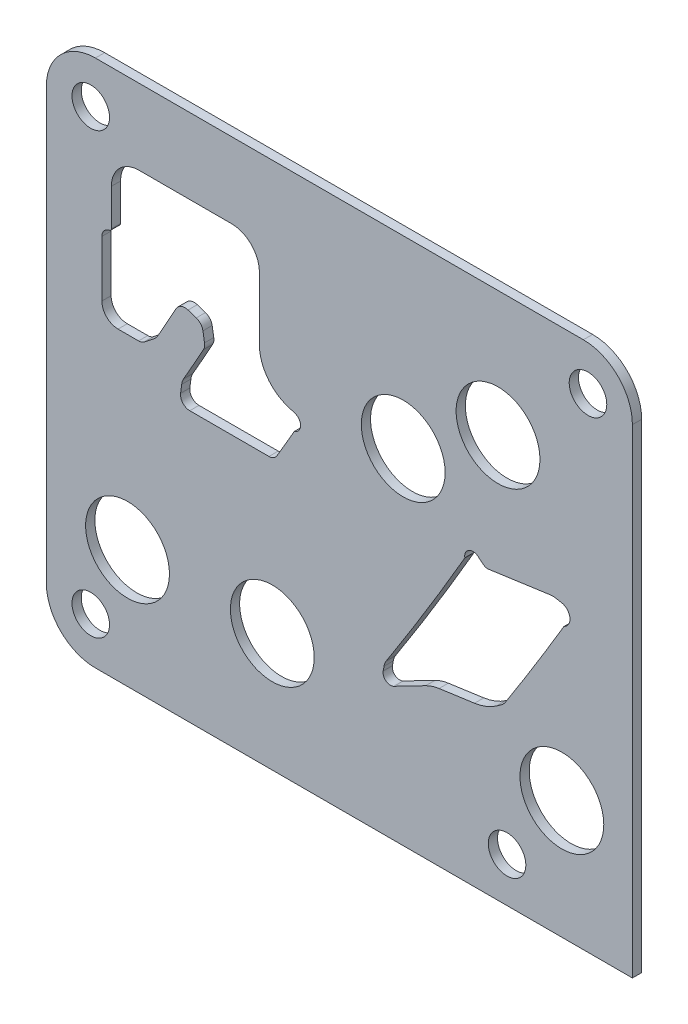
ISO-10303-21;
HEADER;
FILE_DESCRIPTION(('STEP AP214'),'2;1');
FILE_NAME('part.step','',(''),(''),'','','');
FILE_SCHEMA(('AUTOMOTIVE_DESIGN { 1 0 10303 214 1 1 1 1 }'));
ENDSEC;
DATA;
#1=APPLICATION_CONTEXT('core data for automotive mechanical design processes');
#2=APPLICATION_PROTOCOL_DEFINITION('international standard','automotive_design',2000,#1);
#3=PRODUCT_CONTEXT('',#1,'mechanical');
#4=PRODUCT('Part','Part','',(#3));
#5=PRODUCT_RELATED_PRODUCT_CATEGORY('part','',(#4));
#6=PRODUCT_DEFINITION_FORMATION('','',#4);
#7=PRODUCT_DEFINITION_CONTEXT('part definition',#1,'design');
#8=PRODUCT_DEFINITION('design','',#6,#7);
#9=PRODUCT_DEFINITION_SHAPE('','',#8);
#10=(LENGTH_UNIT() NAMED_UNIT(*) SI_UNIT(.MILLI.,.METRE.));
#11=(NAMED_UNIT(*) PLANE_ANGLE_UNIT() SI_UNIT($,.RADIAN.));
#12=(NAMED_UNIT(*) SI_UNIT($,.STERADIAN.) SOLID_ANGLE_UNIT());
#13=UNCERTAINTY_MEASURE_WITH_UNIT(LENGTH_MEASURE(1.E-05),#10,'distance_accuracy_value','');
#14=(GEOMETRIC_REPRESENTATION_CONTEXT(3) GLOBAL_UNCERTAINTY_ASSIGNED_CONTEXT((#13)) GLOBAL_UNIT_ASSIGNED_CONTEXT((#10,
#11,#12)) REPRESENTATION_CONTEXT('',''));
#15=CARTESIAN_POINT('',(0.,0.,0.));
#16=DIRECTION('',(0.,0.,1.));
#17=DIRECTION('',(1.,0.,0.));
#18=AXIS2_PLACEMENT_3D('',#15,#16,#17);
#19=CARTESIAN_POINT('',(-866.0765,-18.542,-31.75));
#20=DIRECTION('',(1.,0.,0.));
#21=DIRECTION('',(0.,1.,0.));
#22=AXIS2_PLACEMENT_3D('',#19,#20,#21);
#23=PLANE('',#22);
#24=DIRECTION('',(0.,1.,0.));
#25=VECTOR('',#24,1.);
#26=CARTESIAN_POINT('',(-866.0765,-18.542,-29.21));
#27=LINE('',#26,#25);
#28=CARTESIAN_POINT('',(-866.0765,-18.542,-29.21));
#29=VERTEX_POINT('',#28);
#30=CARTESIAN_POINT('',(-866.0765,113.03,-29.21));
#31=VERTEX_POINT('',#30);
#32=EDGE_CURVE('E862',#29,#31,#27,.T.);
#33=ORIENTED_EDGE('',*,*,#32,.F.);
#34=DIRECTION('',(0.,0.,1.));
#35=VECTOR('',#34,1.);
#36=CARTESIAN_POINT('',(-866.0765,-18.542,-31.75));
#37=LINE('',#36,#35);
#38=CARTESIAN_POINT('',(-866.0765,-18.542,-31.75));
#39=VERTEX_POINT('',#38);
#40=EDGE_CURVE('E11',#39,#29,#37,.T.);
#41=ORIENTED_EDGE('',*,*,#40,.F.);
#42=DIRECTION('',(0.,1.,0.));
#43=VECTOR('',#42,1.);
#44=CARTESIAN_POINT('',(-866.0765,-18.542,-31.75));
#45=LINE('',#44,#43);
#46=CARTESIAN_POINT('',(-866.0765,113.03,-31.75));
#47=VERTEX_POINT('',#46);
#48=EDGE_CURVE('E863',#39,#47,#45,.T.);
#49=ORIENTED_EDGE('',*,*,#48,.T.);
#50=DIRECTION('',(0.,0.,1.));
#51=VECTOR('',#50,1.);
#52=CARTESIAN_POINT('',(-866.0765,113.03,-31.75));
#53=LINE('',#52,#51);
#54=EDGE_CURVE('E46',#47,#31,#53,.T.);
#55=ORIENTED_EDGE('',*,*,#54,.T.);
#56=EDGE_LOOP('',(#33,#41,#49,#55));
#57=FACE_BOUND('',#56,.T.);
#58=ADVANCED_FACE('F43',(#57),#23,.T.);
#59=CARTESIAN_POINT('',(-1013.5235,-18.542,-31.75));
#60=DIRECTION('',(0.,-1.,0.));
#61=DIRECTION('',(1.,0.,0.));
#62=AXIS2_PLACEMENT_3D('',#59,#60,#61);
#63=PLANE('',#62);
#64=DIRECTION('',(1.,0.,0.));
#65=VECTOR('',#64,1.);
#66=CARTESIAN_POINT('',(-1013.5235,-18.542,-29.21));
#67=LINE('',#66,#65);
#68=CARTESIAN_POINT('',(-1013.5235,-18.542,-29.21));
#69=VERTEX_POINT('',#68);
#70=EDGE_CURVE('E867',#69,#29,#67,.T.);
#71=ORIENTED_EDGE('',*,*,#70,.F.);
#72=DIRECTION('',(0.,0.,1.));
#73=VECTOR('',#72,1.);
#74=CARTESIAN_POINT('',(-1013.5235,-18.542,-31.75));
#75=LINE('',#74,#73);
#76=CARTESIAN_POINT('',(-1013.5235,-18.542,-31.75));
#77=VERTEX_POINT('',#76);
#78=EDGE_CURVE('E51',#77,#69,#75,.T.);
#79=ORIENTED_EDGE('',*,*,#78,.F.);
#80=DIRECTION('',(1.,0.,0.));
#81=VECTOR('',#80,1.);
#82=CARTESIAN_POINT('',(-1013.5235,-18.542,-31.75));
#83=LINE('',#82,#81);
#84=EDGE_CURVE('E882',#77,#39,#83,.T.);
#85=ORIENTED_EDGE('',*,*,#84,.T.);
#86=ORIENTED_EDGE('',*,*,#40,.T.);
#87=EDGE_LOOP('',(#71,#79,#85,#86));
#88=FACE_BOUND('',#87,.T.);
#89=ADVANCED_FACE('F924',(#88),#63,.T.);
#90=CARTESIAN_POINT('',(-1013.5235,-5.08000000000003,-31.75));
#91=DIRECTION('',(0.,0.,1.));
#92=DIRECTION('',(1.,0.,0.));
#93=AXIS2_PLACEMENT_3D('',#90,#91,#92);
#94=CYLINDRICAL_SURFACE('',#93,13.462);
#95=CARTESIAN_POINT('',(-1013.5235,-5.08000000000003,-29.21));
#96=DIRECTION('',(0.,0.,1.));
#97=DIRECTION('',(1.,0.,0.));
#98=AXIS2_PLACEMENT_3D('',#95,#96,#97);
#99=CIRCLE('',#98,13.462);
#100=CARTESIAN_POINT('',(-1026.9855,-5.08000000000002,-29.21));
#101=VERTEX_POINT('',#100);
#102=EDGE_CURVE('E899',#101,#69,#99,.T.);
#103=ORIENTED_EDGE('',*,*,#102,.F.);
#104=DIRECTION('',(0.,0.,1.));
#105=VECTOR('',#104,1.);
#106=CARTESIAN_POINT('',(-1026.9855,-5.08000000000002,-31.75));
#107=LINE('',#106,#105);
#108=CARTESIAN_POINT('',(-1026.9855,-5.08000000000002,-31.75));
#109=VERTEX_POINT('',#108);
#110=EDGE_CURVE('E905',#109,#101,#107,.T.);
#111=ORIENTED_EDGE('',*,*,#110,.F.);
#112=CARTESIAN_POINT('',(-1013.5235,-5.08000000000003,-31.75));
#113=DIRECTION('',(0.,0.,1.));
#114=DIRECTION('',(1.,0.,0.));
#115=AXIS2_PLACEMENT_3D('',#112,#113,#114);
#116=CIRCLE('',#115,13.462);
#117=EDGE_CURVE('E879',#109,#77,#116,.T.);
#118=ORIENTED_EDGE('',*,*,#117,.T.);
#119=ORIENTED_EDGE('',*,*,#78,.T.);
#120=EDGE_LOOP('',(#103,#111,#118,#119));
#121=FACE_BOUND('',#120,.T.);
#122=ADVANCED_FACE('F940',(#121),#94,.T.);
#123=CARTESIAN_POINT('',(-1026.9855,113.03,-31.75));
#124=DIRECTION('',(-1.,0.,0.));
#125=DIRECTION('',(0.,0.,1.));
#126=AXIS2_PLACEMENT_3D('',#123,#124,#125);
#127=PLANE('',#126);
#128=DIRECTION('',(0.,-1.,0.));
#129=VECTOR('',#128,1.);
#130=CARTESIAN_POINT('',(-1026.9855,113.03,-29.21));
#131=LINE('',#130,#129);
#132=CARTESIAN_POINT('',(-1026.9855,113.03,-29.21));
#133=VERTEX_POINT('',#132);
#134=EDGE_CURVE('E896',#133,#101,#131,.T.);
#135=ORIENTED_EDGE('',*,*,#134,.F.);
#136=DIRECTION('',(0.,0.,1.));
#137=VECTOR('',#136,1.);
#138=CARTESIAN_POINT('',(-1026.9855,113.03,-31.75));
#139=LINE('',#138,#137);
#140=CARTESIAN_POINT('',(-1026.9855,113.03,-31.75));
#141=VERTEX_POINT('',#140);
#142=EDGE_CURVE('E907',#141,#133,#139,.T.);
#143=ORIENTED_EDGE('',*,*,#142,.F.);
#144=DIRECTION('',(0.,-1.,0.));
#145=VECTOR('',#144,1.);
#146=CARTESIAN_POINT('',(-1026.9855,113.03,-31.75));
#147=LINE('',#146,#145);
#148=EDGE_CURVE('E876',#141,#109,#147,.T.);
#149=ORIENTED_EDGE('',*,*,#148,.T.);
#150=ORIENTED_EDGE('',*,*,#110,.T.);
#151=EDGE_LOOP('',(#135,#143,#149,#150));
#152=FACE_BOUND('',#151,.T.);
#153=ADVANCED_FACE('F938',(#152),#127,.T.);
#154=CARTESIAN_POINT('',(-1013.5235,113.03,-31.75));
#155=DIRECTION('',(0.,0.,1.));
#156=DIRECTION('',(1.,0.,0.));
#157=AXIS2_PLACEMENT_3D('',#154,#155,#156);
#158=CYLINDRICAL_SURFACE('',#157,13.462);
#159=CARTESIAN_POINT('',(-1013.5235,113.03,-29.21));
#160=DIRECTION('',(0.,0.,1.));
#161=DIRECTION('',(1.,0.,0.));
#162=AXIS2_PLACEMENT_3D('',#159,#160,#161);
#163=CIRCLE('',#162,13.462);
#164=CARTESIAN_POINT('',(-1013.5235,126.492,-29.21));
#165=VERTEX_POINT('',#164);
#166=EDGE_CURVE('E893',#165,#133,#163,.T.);
#167=ORIENTED_EDGE('',*,*,#166,.F.);
#168=DIRECTION('',(0.,0.,1.));
#169=VECTOR('',#168,1.);
#170=CARTESIAN_POINT('',(-1013.5235,126.492,-31.75));
#171=LINE('',#170,#169);
#172=CARTESIAN_POINT('',(-1013.5235,126.492,-31.75));
#173=VERTEX_POINT('',#172);
#174=EDGE_CURVE('E909',#173,#165,#171,.T.);
#175=ORIENTED_EDGE('',*,*,#174,.F.);
#176=CARTESIAN_POINT('',(-1013.5235,113.03,-31.75));
#177=DIRECTION('',(0.,0.,1.));
#178=DIRECTION('',(1.,0.,0.));
#179=AXIS2_PLACEMENT_3D('',#176,#177,#178);
#180=CIRCLE('',#179,13.462);
#181=EDGE_CURVE('E873',#173,#141,#180,.T.);
#182=ORIENTED_EDGE('',*,*,#181,.T.);
#183=ORIENTED_EDGE('',*,*,#142,.T.);
#184=EDGE_LOOP('',(#167,#175,#182,#183));
#185=FACE_BOUND('',#184,.T.);
#186=ADVANCED_FACE('F936',(#185),#158,.T.);
#187=CARTESIAN_POINT('',(-879.5385,126.492,-31.75));
#188=DIRECTION('',(0.,1.,0.));
#189=DIRECTION('',(-1.,0.,0.));
#190=AXIS2_PLACEMENT_3D('',#187,#188,#189);
#191=PLANE('',#190);
#192=DIRECTION('',(-1.,0.,0.));
#193=VECTOR('',#192,1.);
#194=CARTESIAN_POINT('',(-879.5385,126.492,-29.21));
#195=LINE('',#194,#193);
#196=CARTESIAN_POINT('',(-879.5385,126.492,-29.21));
#197=VERTEX_POINT('',#196);
#198=EDGE_CURVE('E890',#197,#165,#195,.T.);
#199=ORIENTED_EDGE('',*,*,#198,.F.);
#200=DIRECTION('',(0.,0.,1.));
#201=VECTOR('',#200,1.);
#202=CARTESIAN_POINT('',(-879.5385,126.492,-31.75));
#203=LINE('',#202,#201);
#204=CARTESIAN_POINT('',(-879.5385,126.492,-31.75));
#205=VERTEX_POINT('',#204);
#206=EDGE_CURVE('E910',#205,#197,#203,.T.);
#207=ORIENTED_EDGE('',*,*,#206,.F.);
#208=DIRECTION('',(-1.,0.,0.));
#209=VECTOR('',#208,1.);
#210=CARTESIAN_POINT('',(-879.5385,126.492,-31.75));
#211=LINE('',#210,#209);
#212=EDGE_CURVE('E870',#205,#173,#211,.T.);
#213=ORIENTED_EDGE('',*,*,#212,.T.);
#214=ORIENTED_EDGE('',*,*,#174,.T.);
#215=EDGE_LOOP('',(#199,#207,#213,#214));
#216=FACE_BOUND('',#215,.T.);
#217=ADVANCED_FACE('F932',(#216),#191,.T.);
#218=CARTESIAN_POINT('',(-879.5385,113.03,-31.75));
#219=DIRECTION('',(0.,0.,1.));
#220=DIRECTION('',(1.,0.,0.));
#221=AXIS2_PLACEMENT_3D('',#218,#219,#220);
#222=CYLINDRICAL_SURFACE('',#221,13.462);
#223=CARTESIAN_POINT('',(-879.5385,113.03,-29.21));
#224=DIRECTION('',(0.,0.,1.));
#225=DIRECTION('',(1.,0.,0.));
#226=AXIS2_PLACEMENT_3D('',#223,#224,#225);
#227=CIRCLE('',#226,13.462);
#228=EDGE_CURVE('E887',#31,#197,#227,.T.);
#229=ORIENTED_EDGE('',*,*,#228,.F.);
#230=ORIENTED_EDGE('',*,*,#54,.F.);
#231=CARTESIAN_POINT('',(-879.5385,113.03,-31.75));
#232=DIRECTION('',(0.,0.,1.));
#233=DIRECTION('',(1.,0.,0.));
#234=AXIS2_PLACEMENT_3D('',#231,#232,#233);
#235=CIRCLE('',#234,13.462);
#236=EDGE_CURVE('E866',#47,#205,#235,.T.);
#237=ORIENTED_EDGE('',*,*,#236,.T.);
#238=ORIENTED_EDGE('',*,*,#206,.T.);
#239=EDGE_LOOP('',(#229,#230,#237,#238));
#240=FACE_BOUND('',#239,.T.);
#241=ADVANCED_FACE('F918',(#240),#222,.T.);
#242=CARTESIAN_POINT('',(-879.5385,113.03,-31.75));
#243=DIRECTION('',(0.,0.,1.));
#244=DIRECTION('',(1.,0.,0.));
#245=AXIS2_PLACEMENT_3D('',#242,#243,#244);
#246=PLANE('',#245);
#247=CARTESIAN_POINT('',(-1007.29796,69.5960000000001,-31.75));
#248=DIRECTION('',(0.,0.,1.));
#249=DIRECTION('',(1.,0.,0.));
#250=AXIS2_PLACEMENT_3D('',#247,#248,#249);
#251=CIRCLE('',#250,4.44500000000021);
#252=CARTESIAN_POINT('',(-1011.74296,69.5960000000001,-31.75));
#253=VERTEX_POINT('',#252);
#254=CARTESIAN_POINT('',(-1007.29796,65.1509999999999,-31.75));
#255=VERTEX_POINT('',#254);
#256=EDGE_CURVE('E433',#253,#255,#251,.T.);
#257=ORIENTED_EDGE('',*,*,#256,.T.);
#258=DIRECTION('',(1.,0.,0.));
#259=VECTOR('',#258,1.);
#260=CARTESIAN_POINT('',(-1004.697,65.151,-31.75));
#261=LINE('',#260,#259);
#262=CARTESIAN_POINT('',(-1001.66258489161,65.1510000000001,-31.75));
#263=VERTEX_POINT('',#262);
#264=EDGE_CURVE('E483',#255,#263,#261,.T.);
#265=ORIENTED_EDGE('',*,*,#264,.T.);
#266=CARTESIAN_POINT('',(-1001.66258489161,67.691,-31.75));
#267=DIRECTION('',(0.,0.,1.));
#268=DIRECTION('',(1.,0.,0.));
#269=AXIS2_PLACEMENT_3D('',#266,#267,#268);
#270=CIRCLE('',#269,2.5399999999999);
#271=CARTESIAN_POINT('',(-1000.10004174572,65.6884868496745,-31.75));
#272=VERTEX_POINT('',#271);
#273=EDGE_CURVE('E486',#263,#272,#270,.T.);
#274=ORIENTED_EDGE('',*,*,#273,.T.);
#275=DIRECTION('',(0.788391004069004,0.615174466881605,0.));
#276=VECTOR('',#275,1.);
#277=CARTESIAN_POINT('',(-1000.10004174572,65.6884868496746,-31.75));
#278=LINE('',#277,#276);
#279=CARTESIAN_POINT('',(-997.474178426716,67.7374245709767,-31.75));
#280=VERTEX_POINT('',#279);
#281=EDGE_CURVE('E489',#272,#280,#278,.T.);
#282=ORIENTED_EDGE('',*,*,#281,.T.);
#283=CARTESIAN_POINT('',(-1000.13050177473,71.1416969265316,-31.75));
#284=DIRECTION('',(0.,0.,1.));
#285=DIRECTION('',(1.,0.,0.));
#286=AXIS2_PLACEMENT_3D('',#283,#284,#285);
#287=CIRCLE('',#286,4.31799999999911);
#288=CARTESIAN_POINT('',(-996.375778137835,69.009286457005,-31.75));
#289=VERTEX_POINT('',#288);
#290=EDGE_CURVE('E492',#280,#289,#287,.T.);
#291=ORIENTED_EDGE('',*,*,#290,.T.);
#292=CARTESIAN_POINT('',(-1733.41846147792,487.596028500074,-31.75));
#293=DIRECTION('',(0.,0.,1.));
#294=DIRECTION('',(1.,0.,0.));
#295=AXIS2_PLACEMENT_3D('',#292,#293,#294);
#296=CIRCLE('',#295,847.612398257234);
#297=CARTESIAN_POINT('',(-991.333462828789,78.0149834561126,-31.75));
#298=VERTEX_POINT('',#297);
#299=EDGE_CURVE('E495',#289,#298,#296,.T.);
#300=ORIENTED_EDGE('',*,*,#299,.T.);
#301=CARTESIAN_POINT('',(-988.94334672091,76.6958000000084,-31.75));
#302=DIRECTION('',(0.,0.,-1.));
#303=DIRECTION('',(1.,0.,0.));
#304=AXIS2_PLACEMENT_3D('',#301,#302,#303);
#305=CIRCLE('',#304,2.72999999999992);
#306=CARTESIAN_POINT('',(-988.083300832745,79.2867884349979,-31.75));
#307=VERTEX_POINT('',#306);
#308=EDGE_CURVE('E498',#298,#307,#305,.T.);
#309=ORIENTED_EDGE('',*,*,#308,.T.);
#310=DIRECTION('',(0.949080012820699,-0.315035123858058,0.));
#311=VECTOR('',#310,1.);
#312=CARTESIAN_POINT('',(-988.083300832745,79.2867884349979,-31.75));
#313=LINE('',#312,#311);
#314=CARTESIAN_POINT('',(-985.827056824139,78.5378567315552,-31.75));
#315=VERTEX_POINT('',#314);
#316=EDGE_CURVE('E501',#307,#315,#313,.T.);
#317=ORIENTED_EDGE('',*,*,#316,.T.);
#318=CARTESIAN_POINT('',(-986.687102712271,75.9468682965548,-31.75));
#319=DIRECTION('',(0.,0.,-1.));
#320=DIRECTION('',(1.,0.,0.));
#321=AXIS2_PLACEMENT_3D('',#318,#319,#320);
#322=CIRCLE('',#321,2.72999999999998);
#323=CARTESIAN_POINT('',(-983.993294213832,76.3899210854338,-31.75));
#324=VERTEX_POINT('',#323);
#325=EDGE_CURVE('E504',#315,#324,#322,.T.);
#326=ORIENTED_EDGE('',*,*,#325,.T.);
#327=DIRECTION('',(0.162290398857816,-0.986743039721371,0.));
#328=VECTOR('',#327,1.);
#329=CARTESIAN_POINT('',(-983.993294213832,76.3899210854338,-31.75));
#330=LINE('',#329,#328);
#331=CARTESIAN_POINT('',(-983.557706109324,73.7414986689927,-31.75));
#332=VERTEX_POINT('',#331);
#333=EDGE_CURVE('E507',#324,#332,#330,.T.);
#334=ORIENTED_EDGE('',*,*,#333,.T.);
#335=CARTESIAN_POINT('',(-986.251514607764,73.2984458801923,-31.75));
#336=DIRECTION('',(0.,0.,-1.));
#337=DIRECTION('',(1.,0.,0.));
#338=AXIS2_PLACEMENT_3D('',#335,#336,#337);
#339=CIRCLE('',#338,2.72999999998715);
#340=CARTESIAN_POINT('',(-983.863987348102,71.974582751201,-31.75));
#341=VERTEX_POINT('',#340);
#342=EDGE_CURVE('E510',#332,#341,#339,.T.);
#343=ORIENTED_EDGE('',*,*,#342,.T.);
#344=CARTESIAN_POINT('',(-1733.41846147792,487.596028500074,-31.75));
#345=DIRECTION('',(0.,0.,-1.));
#346=DIRECTION('',(1.,0.,0.));
#347=AXIS2_PLACEMENT_3D('',#344,#345,#346);
#348=CIRCLE('',#347,857.07239825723);
#349=CARTESIAN_POINT('',(-989.301648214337,62.3158102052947,-31.75));
#350=VERTEX_POINT('',#349);
#351=EDGE_CURVE('E513',#341,#350,#348,.T.);
#352=ORIENTED_EDGE('',*,*,#351,.T.);
#353=CARTESIAN_POINT('',(-985.552727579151,60.17321409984,-31.75));
#354=DIRECTION('',(0.,0.,1.));
#355=DIRECTION('',(1.,0.,0.));
#356=AXIS2_PLACEMENT_3D('',#353,#354,#355);
#357=CIRCLE('',#356,4.31800000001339);
#358=CARTESIAN_POINT('',(-989.834878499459,60.7284685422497,-31.75));
#359=VERTEX_POINT('',#358);
#360=EDGE_CURVE('E516',#350,#359,#357,.T.);
#361=ORIENTED_EDGE('',*,*,#360,.T.);
#362=DIRECTION('',(-0.128590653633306,-0.991697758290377,0.));
#363=VECTOR('',#362,1.);
#364=CARTESIAN_POINT('',(-989.834878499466,60.7284685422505,-31.75));
#365=LINE('',#364,#363);
#366=CARTESIAN_POINT('',(-990.130310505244,58.450081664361,-31.75));
#367=VERTEX_POINT('',#366);
#368=EDGE_CURVE('E519',#359,#367,#365,.T.);
#369=ORIENTED_EDGE('',*,*,#368,.T.);
#370=CARTESIAN_POINT('',(-987.611398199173,58.123461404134,-31.75));
#371=DIRECTION('',(0.,0.,1.));
#372=DIRECTION('',(1.,0.,0.));
#373=AXIS2_PLACEMENT_3D('',#370,#371,#372);
#374=CIRCLE('',#373,2.54000000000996);
#375=CARTESIAN_POINT('',(-987.611398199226,55.5834614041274,-31.75));
#376=VERTEX_POINT('',#375);
#377=EDGE_CURVE('E448',#367,#376,#374,.T.);
#378=ORIENTED_EDGE('',*,*,#377,.T.);
#379=DIRECTION('',(1.,3.05320911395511E-13,0.));
#380=VECTOR('',#379,1.);
#381=CARTESIAN_POINT('',(-987.611398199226,55.5834614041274,-31.75));
#382=LINE('',#381,#380);
#383=CARTESIAN_POINT('',(-965.862080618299,55.583461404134,-31.75));
#384=VERTEX_POINT('',#383);
#385=EDGE_CURVE('E451',#376,#384,#382,.T.);
#386=ORIENTED_EDGE('',*,*,#385,.T.);
#387=CARTESIAN_POINT('',(-965.862080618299,58.123461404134,-31.75));
#388=DIRECTION('',(0.,0.,1.));
#389=DIRECTION('',(1.,0.,0.));
#390=AXIS2_PLACEMENT_3D('',#387,#388,#389);
#391=CIRCLE('',#390,2.54000000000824);
#392=CARTESIAN_POINT('',(-963.674545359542,56.8326130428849,-31.75));
#393=VERTEX_POINT('',#392);
#394=EDGE_CURVE('E67',#384,#393,#391,.T.);
#395=ORIENTED_EDGE('',*,*,#394,.T.);
#396=CARTESIAN_POINT('',(-1693.66746147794,487.596028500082,-31.75));
#397=DIRECTION('',(0.,0.,1.));
#398=DIRECTION('',(1.,0.,0.));
#399=AXIS2_PLACEMENT_3D('',#396,#397,#398);
#400=CIRCLE('',#399,847.612398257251);
#401=CARTESIAN_POINT('',(-958.921316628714,64.9911535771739,-31.75));
#402=VERTEX_POINT('',#401);
#403=EDGE_CURVE('E456',#393,#402,#400,.T.);
#404=ORIENTED_EDGE('',*,*,#403,.T.);
#405=CARTESIAN_POINT('',(-958.70113872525,64.8645135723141,-31.75));
#406=DIRECTION('',(0.,0.,-1.));
#407=DIRECTION('',(1.,0.,0.));
#408=AXIS2_PLACEMENT_3D('',#405,#406,#407);
#409=CIRCLE('',#408,0.254000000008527);
#410=CARTESIAN_POINT('',(-958.776426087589,65.1070992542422,-31.75));
#411=VERTEX_POINT('',#410);
#412=EDGE_CURVE('E459',#402,#411,#409,.T.);
#413=ORIENTED_EDGE('',*,*,#412,.T.);
#414=CARTESIAN_POINT('',(-959.44926983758,67.2750894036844,-31.75));
#415=DIRECTION('',(0.,0.,1.));
#416=DIRECTION('',(1.,0.,0.));
#417=AXIS2_PLACEMENT_3D('',#414,#415,#416);
#418=CIRCLE('',#417,2.26999999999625);
#419=CARTESIAN_POINT('',(-958.781800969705,69.4447403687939,-31.75));
#420=VERTEX_POINT('',#419);
#421=EDGE_CURVE('E462',#411,#420,#418,.T.);
#422=ORIENTED_EDGE('',*,*,#421,.T.);
#423=DIRECTION('',(-0.955793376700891,0.294039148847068,0.));
#424=VECTOR('',#423,1.);
#425=CARTESIAN_POINT('',(-958.781800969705,69.4447403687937,-31.75));
#426=LINE('',#425,#424);
#427=CARTESIAN_POINT('',(-960.432867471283,69.9526725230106,-31.75));
#428=VERTEX_POINT('',#427);
#429=EDGE_CURVE('E465',#420,#428,#426,.T.);
#430=ORIENTED_EDGE('',*,*,#429,.T.);
#431=CARTESIAN_POINT('',(-957.072,80.8773908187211,-31.75));
#432=DIRECTION('',(0.,0.,-1.));
#433=DIRECTION('',(1.,0.,0.));
#434=AXIS2_PLACEMENT_3D('',#431,#432,#433);
#435=CIRCLE('',#434,11.4300000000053);
#436=CARTESIAN_POINT('',(-968.502000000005,80.877390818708,-31.75));
#437=VERTEX_POINT('',#436);
#438=EDGE_CURVE('E468',#428,#437,#435,.T.);
#439=ORIENTED_EDGE('',*,*,#438,.T.);
#440=DIRECTION('',(2.05435062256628E-13,1.,0.));
#441=VECTOR('',#440,1.);
#442=CARTESIAN_POINT('',(-968.502000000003,80.877390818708,-31.75));
#443=LINE('',#442,#441);
#444=CARTESIAN_POINT('',(-968.502,98.1709999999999,-31.75));
#445=VERTEX_POINT('',#444);
#446=EDGE_CURVE('E471',#437,#445,#443,.T.);
#447=ORIENTED_EDGE('',*,*,#446,.T.);
#448=CARTESIAN_POINT('',(-976.122,98.171,-31.75));
#449=DIRECTION('',(0.,0.,1.));
#450=DIRECTION('',(1.,0.,0.));
#451=AXIS2_PLACEMENT_3D('',#448,#449,#450);
#452=CIRCLE('',#451,7.61999999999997);
#453=CARTESIAN_POINT('',(-976.122,105.791,-31.75));
#454=VERTEX_POINT('',#453);
#455=EDGE_CURVE('E474',#445,#454,#452,.T.);
#456=ORIENTED_EDGE('',*,*,#455,.T.);
#457=DIRECTION('',(-1.,0.,0.));
#458=VECTOR('',#457,1.);
#459=CARTESIAN_POINT('',(-976.122,105.791,-31.75));
#460=LINE('',#459,#458);
#461=CARTESIAN_POINT('',(-1001.522,105.791,-31.75));
#462=VERTEX_POINT('',#461);
#463=EDGE_CURVE('E477',#454,#462,#460,.T.);
#464=ORIENTED_EDGE('',*,*,#463,.T.);
#465=CARTESIAN_POINT('',(-1001.522,98.171,-31.75));
#466=DIRECTION('',(0.,0.,1.));
#467=DIRECTION('',(1.,0.,0.));
#468=AXIS2_PLACEMENT_3D('',#465,#466,#467);
#469=CIRCLE('',#468,7.61999999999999);
#470=CARTESIAN_POINT('',(-1009.142,98.1709999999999,-31.75));
#471=VERTEX_POINT('',#470);
#472=EDGE_CURVE('E480',#462,#471,#469,.T.);
#473=ORIENTED_EDGE('',*,*,#472,.T.);
#474=DIRECTION('',(0.,-1.,0.));
#475=VECTOR('',#474,1.);
#476=CARTESIAN_POINT('',(-1009.142,98.1709999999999,-31.75));
#477=LINE('',#476,#475);
#478=CARTESIAN_POINT('',(-1009.142,88.0856756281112,-31.75));
#479=VERTEX_POINT('',#478);
#480=EDGE_CURVE('E425',#471,#479,#477,.T.);
#481=ORIENTED_EDGE('',*,*,#480,.T.);
#482=CARTESIAN_POINT('',(-1009.77954,88.0856756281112,-31.75));
#483=DIRECTION('',(0.,0.,-1.));
#484=DIRECTION('',(1.,0.,0.));
#485=AXIS2_PLACEMENT_3D('',#482,#483,#484);
#486=CIRCLE('',#485,0.637539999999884);
#487=CARTESIAN_POINT('',(-1009.664272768,87.4586423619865,-31.75));
#488=VERTEX_POINT('',#487);
#489=EDGE_CURVE('E59',#479,#488,#486,.T.);
#490=ORIENTED_EDGE('',*,*,#489,.T.);
#491=CARTESIAN_POINT('',(-1009.2055,84.963,-31.75));
#492=DIRECTION('',(0.,0.,1.));
#493=DIRECTION('',(1.,0.,0.));
#494=AXIS2_PLACEMENT_3D('',#491,#492,#493);
#495=CIRCLE('',#494,2.53746000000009);
#496=CARTESIAN_POINT('',(-1011.74296,84.963,-31.75));
#497=VERTEX_POINT('',#496);
#498=EDGE_CURVE('E412',#488,#497,#495,.T.);
#499=ORIENTED_EDGE('',*,*,#498,.T.);
#500=DIRECTION('',(0.,-1.,0.));
#501=VECTOR('',#500,1.);
#502=CARTESIAN_POINT('',(-1011.74296,84.963,-31.75));
#503=LINE('',#502,#501);
#504=EDGE_CURVE('E417',#497,#253,#503,.T.);
#505=ORIENTED_EDGE('',*,*,#504,.T.);
#506=EDGE_LOOP('',(#257,#265,#274,#282,#291,#300,#309,#317,#326,#334,#343,#352,#361,#369,#378,
#386,#395,#404,#413,#422,#430,#439,#447,#456,#464,#473,#481,#490,#499,#505));
#507=FACE_BOUND('',#506,.T.);
#508=CARTESIAN_POINT('',(-1653.91646147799,487.596028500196,-31.75));
#509=DIRECTION('',(0.,0.,-1.));
#510=DIRECTION('',(1.,0.,0.));
#511=AXIS2_PLACEMENT_3D('',#508,#509,#510);
#512=CIRCLE('',#511,857.072398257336);
#513=CARTESIAN_POINT('',(-912.132598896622,58.2595671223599,-31.75));
#514=VERTEX_POINT('',#513);
#515=CARTESIAN_POINT('',(-933.65245147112,23.0609364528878,-31.75));
#516=VERTEX_POINT('',#515);
#517=EDGE_CURVE('E707',#514,#516,#512,.T.);
#518=ORIENTED_EDGE('',*,*,#517,.T.);
#519=CARTESIAN_POINT('',(-930.023703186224,20.7205711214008,-31.75));
#520=DIRECTION('',(0.,0.,1.));
#521=DIRECTION('',(1.,0.,0.));
#522=AXIS2_PLACEMENT_3D('',#519,#520,#521);
#523=CIRCLE('',#522,4.31799999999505);
#524=CARTESIAN_POINT('',(-934.269956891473,21.5044419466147,-31.75));
#525=VERTEX_POINT('',#524);
#526=EDGE_CURVE('E649',#516,#525,#523,.T.);
#527=ORIENTED_EDGE('',*,*,#526,.T.);
#528=DIRECTION('',(-0.18153562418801,-0.983384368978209,0.));
#529=VECTOR('',#528,1.);
#530=CARTESIAN_POINT('',(-934.269956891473,21.5044419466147,-31.75));
#531=LINE('',#530,#529);
#532=CARTESIAN_POINT('',(-934.50223765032,20.2461695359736,-31.75));
#533=VERTEX_POINT('',#532);
#534=EDGE_CURVE('E652',#525,#533,#531,.T.);
#535=ORIENTED_EDGE('',*,*,#534,.T.);
#536=CARTESIAN_POINT('',(-932.504000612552,19.877289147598,-31.75));
#537=DIRECTION('',(0.,0.,1.));
#538=DIRECTION('',(1.,0.,0.));
#539=AXIS2_PLACEMENT_3D('',#536,#537,#538);
#540=CIRCLE('',#539,2.03199999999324);
#541=CARTESIAN_POINT('',(-931.571179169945,18.072055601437,-31.75));
#542=VERTEX_POINT('',#541);
#543=EDGE_CURVE('E656',#533,#542,#540,.T.);
#544=ORIENTED_EDGE('',*,*,#543,.T.);
#545=DIRECTION('',(0.888402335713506,0.459065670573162,0.));
#546=VECTOR('',#545,1.);
#547=CARTESIAN_POINT('',(-931.571179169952,18.0720556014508,-31.75));
#548=LINE('',#547,#546);
#549=CARTESIAN_POINT('',(-922.821117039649,22.593490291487,-31.75));
#550=VERTEX_POINT('',#549);
#551=EDGE_CURVE('E659',#542,#550,#548,.T.);
#552=ORIENTED_EDGE('',*,*,#551,.T.);
#553=CARTESIAN_POINT('',(-917.573996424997,12.439051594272,-31.75));
#554=DIRECTION('',(0.,0.,-1.));
#555=DIRECTION('',(1.,0.,0.));
#556=AXIS2_PLACEMENT_3D('',#553,#554,#555);
#557=CIRCLE('',#556,11.4300000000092);
#558=CARTESIAN_POINT('',(-919.164744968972,23.7578156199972,-31.75));
#559=VERTEX_POINT('',#558);
#560=EDGE_CURVE('E662',#550,#559,#557,.T.);
#561=ORIENTED_EDGE('',*,*,#560,.T.);
#562=DIRECTION('',(0.990268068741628,0.139173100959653,0.));
#563=VECTOR('',#562,1.);
#564=CARTESIAN_POINT('',(-919.164744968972,23.7578156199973,-31.75));
#565=LINE('',#564,#563);
#566=CARTESIAN_POINT('',(-909.411385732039,25.1285608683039,-31.75));
#567=VERTEX_POINT('',#566);
#568=EDGE_CURVE('E665',#559,#567,#565,.T.);
#569=ORIENTED_EDGE('',*,*,#568,.T.);
#570=CARTESIAN_POINT('',(-911.355633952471,38.9626057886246,-31.75));
#571=DIRECTION('',(0.,0.,1.));
#572=DIRECTION('',(1.,0.,0.));
#573=AXIS2_PLACEMENT_3D('',#570,#571,#572);
#574=CIRCLE('',#573,13.9700000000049);
#575=CARTESIAN_POINT('',(-903.37279707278,27.4980859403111,-31.75));
#576=VERTEX_POINT('',#575);
#577=EDGE_CURVE('E668',#567,#576,#574,.T.);
#578=ORIENTED_EDGE('',*,*,#577,.T.);
#579=DIRECTION('',(0.82065281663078,0.571427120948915,0.));
#580=VECTOR('',#579,1.);
#581=CARTESIAN_POINT('',(-903.372797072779,27.4980859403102,-31.75));
#582=LINE('',#581,#580);
#583=CARTESIAN_POINT('',(-902.122122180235,28.3689408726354,-31.75));
#584=VERTEX_POINT('',#583);
#585=EDGE_CURVE('E671',#576,#584,#582,.T.);
#586=ORIENTED_EDGE('',*,*,#585,.T.);
#587=CARTESIAN_POINT('',(-904.589544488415,31.912519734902,-31.75));
#588=DIRECTION('',(0.,0.,1.));
#589=DIRECTION('',(1.,0.,0.));
#590=AXIS2_PLACEMENT_3D('',#587,#588,#589);
#591=CIRCLE('',#590,4.31800000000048);
#592=CARTESIAN_POINT('',(-900.95623586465,29.5792404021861,-31.75));
#593=VERTEX_POINT('',#592);
#594=EDGE_CURVE('E674',#584,#593,#591,.T.);
#595=ORIENTED_EDGE('',*,*,#594,.T.);
#596=CARTESIAN_POINT('',(-1614.16546147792,487.596028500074,-31.75));
#597=DIRECTION('',(0.,0.,1.));
#598=DIRECTION('',(1.,0.,0.));
#599=AXIS2_PLACEMENT_3D('',#596,#597,#598);
#600=CIRCLE('',#599,847.612398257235);
#601=CARTESIAN_POINT('',(-884.894485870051,55.6115127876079,-31.75));
#602=VERTEX_POINT('',#601);
#603=EDGE_CURVE('E677',#593,#602,#600,.T.);
#604=ORIENTED_EDGE('',*,*,#603,.T.);
#605=CARTESIAN_POINT('',(-884.675948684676,55.4820620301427,-31.75));
#606=DIRECTION('',(0.,0.,-1.));
#607=DIRECTION('',(1.,0.,0.));
#608=AXIS2_PLACEMENT_3D('',#605,#606,#607);
#609=CIRCLE('',#608,0.253999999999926);
#610=CARTESIAN_POINT('',(-884.786733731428,55.7106285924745,-31.75));
#611=VERTEX_POINT('',#610);
#612=EDGE_CURVE('E680',#602,#611,#609,.T.);
#613=ORIENTED_EDGE('',*,*,#612,.T.);
#614=CARTESIAN_POINT('',(-886.005369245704,58.2248607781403,-31.75));
#615=DIRECTION('',(0.,0.,1.));
#616=DIRECTION('',(1.,0.,0.));
#617=AXIS2_PLACEMENT_3D('',#614,#615,#616);
#618=CIRCLE('',#617,2.79400000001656);
#619=CARTESIAN_POINT('',(-885.5201962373,60.9764136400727,-31.75));
#620=VERTEX_POINT('',#619);
#621=EDGE_CURVE('E683',#611,#620,#618,.T.);
#622=ORIENTED_EDGE('',*,*,#621,.T.);
#623=DIRECTION('',(-0.984807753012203,0.173648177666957,0.));
#624=VECTOR('',#623,1.);
#625=CARTESIAN_POINT('',(-885.5201962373,60.9764136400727,-31.75));
#626=LINE('',#625,#624);
#627=CARTESIAN_POINT('',(-887.20488919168,61.2734704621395,-31.75));
#628=VERTEX_POINT('',#627);
#629=EDGE_CURVE('E686',#620,#628,#626,.T.);
#630=ORIENTED_EDGE('',*,*,#629,.T.);
#631=CARTESIAN_POINT('',(-887.976755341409,56.896,-31.75));
#632=DIRECTION('',(0.,0.,1.));
#633=DIRECTION('',(1.,0.,0.));
#634=AXIS2_PLACEMENT_3D('',#631,#632,#633);
#635=CIRCLE('',#634,4.44500000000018);
#636=CARTESIAN_POINT('',(-888.595379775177,61.2977415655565,-31.75));
#637=VERTEX_POINT('',#636);
#638=EDGE_CURVE('E689',#628,#637,#635,.T.);
#639=ORIENTED_EDGE('',*,*,#638,.T.);
#640=DIRECTION('',(-0.990268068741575,-0.139173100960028,0.));
#641=VECTOR('',#640,1.);
#642=CARTESIAN_POINT('',(-888.595379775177,61.2977415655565,-31.75));
#643=LINE('',#642,#641);
#644=CARTESIAN_POINT('',(-905.551637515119,58.9146949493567,-31.75));
#645=VERTEX_POINT('',#644);
#646=EDGE_CURVE('E692',#637,#645,#643,.T.);
#647=ORIENTED_EDGE('',*,*,#646,.T.);
#648=CARTESIAN_POINT('',(-905.816762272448,60.8011556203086,-31.75));
#649=DIRECTION('',(0.,0.,-1.));
#650=DIRECTION('',(1.,0.,0.));
#651=AXIS2_PLACEMENT_3D('',#648,#649,#650);
#652=CIRCLE('',#651,1.90499999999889);
#653=CARTESIAN_POINT('',(-907.033169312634,59.3350795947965,-31.75));
#654=VERTEX_POINT('',#653);
#655=EDGE_CURVE('E695',#645,#654,#652,.T.);
#656=ORIENTED_EDGE('',*,*,#655,.T.);
#657=DIRECTION('',(-0.769593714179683,0.638533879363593,0.));
#658=VECTOR('',#657,1.);
#659=CARTESIAN_POINT('',(-907.033169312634,59.3350795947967,-31.75));
#660=LINE('',#659,#658);
#661=CARTESIAN_POINT('',(-908.401506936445,60.470392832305,-31.75));
#662=VERTEX_POINT('',#661);
#663=EDGE_CURVE('E698',#654,#662,#660,.T.);
#664=ORIENTED_EDGE('',*,*,#663,.T.);
#665=CARTESIAN_POINT('',(-909.850978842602,58.7234151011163,-31.75));
#666=DIRECTION('',(0.,0.,1.));
#667=DIRECTION('',(1.,0.,0.));
#668=AXIS2_PLACEMENT_3D('',#665,#666,#667);
#669=CIRCLE('',#668,2.27000000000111);
#670=CARTESIAN_POINT('',(-912.100701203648,58.4206787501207,-31.75));
#671=VERTEX_POINT('',#670);
#672=EDGE_CURVE('E701',#662,#671,#669,.T.);
#673=ORIENTED_EDGE('',*,*,#672,.T.);
#674=CARTESIAN_POINT('',(-912.35243225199,58.3868042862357,-31.75));
#675=DIRECTION('',(0.,0.,-1.));
#676=DIRECTION('',(1.,0.,0.));
#677=AXIS2_PLACEMENT_3D('',#674,#675,#676);
#678=CIRCLE('',#677,0.254000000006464);
#679=EDGE_CURVE('E704',#671,#514,#678,.T.);
#680=ORIENTED_EDGE('',*,*,#679,.T.);
#681=EDGE_LOOP('',(#518,#527,#535,#544,#552,#561,#569,#578,#586,#595,#604,#613,#622,#630,#639,
#647,#656,#664,#673,#680));
#682=FACE_BOUND('',#681,.T.);
#683=CARTESIAN_POINT('',(-900.4935,-6.34999999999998,-31.75));
#684=DIRECTION('',(0.,0.,1.));
#685=DIRECTION('',(1.,0.,0.));
#686=AXIS2_PLACEMENT_3D('',#683,#684,#685);
#687=CIRCLE('',#686,5.15619999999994);
#688=CARTESIAN_POINT('',(-895.3373,-6.34999999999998,-31.75));
#689=VERTEX_POINT('',#688);
#690=EDGE_CURVE('E811',#689,#689,#687,.T.);
#691=ORIENTED_EDGE('',*,*,#690,.T.);
#692=EDGE_LOOP('',(#691));
#693=FACE_BOUND('',#692,.T.);
#694=CARTESIAN_POINT('',(-878.2685,114.3,-31.75));
#695=DIRECTION('',(0.,0.,1.));
#696=DIRECTION('',(1.,0.,0.));
#697=AXIS2_PLACEMENT_3D('',#694,#695,#696);
#698=CIRCLE('',#697,5.15619999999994);
#699=CARTESIAN_POINT('',(-873.1123,114.3,-31.75));
#700=VERTEX_POINT('',#699);
#701=EDGE_CURVE('E817',#700,#700,#698,.T.);
#702=ORIENTED_EDGE('',*,*,#701,.T.);
#703=EDGE_LOOP('',(#702));
#704=FACE_BOUND('',#703,.T.);
#705=CARTESIAN_POINT('',(-1014.7935,114.3,-31.75));
#706=DIRECTION('',(0.,0.,1.));
#707=DIRECTION('',(1.,0.,0.));
#708=AXIS2_PLACEMENT_3D('',#705,#706,#707);
#709=CIRCLE('',#708,5.15620000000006);
#710=CARTESIAN_POINT('',(-1009.6373,114.3,-31.75));
#711=VERTEX_POINT('',#710);
#712=EDGE_CURVE('E823',#711,#711,#709,.T.);
#713=ORIENTED_EDGE('',*,*,#712,.T.);
#714=EDGE_LOOP('',(#713));
#715=FACE_BOUND('',#714,.T.);
#716=CARTESIAN_POINT('',(-1014.7935,-6.34999999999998,-31.75));
#717=DIRECTION('',(0.,0.,1.));
#718=DIRECTION('',(1.,0.,0.));
#719=AXIS2_PLACEMENT_3D('',#716,#717,#718);
#720=CIRCLE('',#719,5.15620000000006);
#721=CARTESIAN_POINT('',(-1009.6373,-6.34999999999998,-31.75));
#722=VERTEX_POINT('',#721);
#723=EDGE_CURVE('E829',#722,#722,#720,.T.);
#724=ORIENTED_EDGE('',*,*,#723,.T.);
#725=EDGE_LOOP('',(#724));
#726=FACE_BOUND('',#725,.T.);
#727=CARTESIAN_POINT('',(-1004.697,13.97,-31.75));
#728=DIRECTION('',(0.,0.,1.));
#729=DIRECTION('',(1.,0.,0.));
#730=AXIS2_PLACEMENT_3D('',#727,#728,#729);
#731=CIRCLE('',#730,11.509375);
#732=CARTESIAN_POINT('',(-993.187625,13.97,-31.75));
#733=VERTEX_POINT('',#732);
#734=EDGE_CURVE('E832',#733,#733,#731,.T.);
#735=ORIENTED_EDGE('',*,*,#734,.T.);
#736=EDGE_LOOP('',(#735));
#737=FACE_BOUND('',#736,.T.);
#738=CARTESIAN_POINT('',(-964.946,13.97,-31.75));
#739=DIRECTION('',(0.,0.,1.));
#740=DIRECTION('',(1.,0.,0.));
#741=AXIS2_PLACEMENT_3D('',#738,#739,#740);
#742=CIRCLE('',#741,11.509375);
#743=CARTESIAN_POINT('',(-953.436625,13.97,-31.75));
#744=VERTEX_POINT('',#743);
#745=EDGE_CURVE('E838',#744,#744,#742,.T.);
#746=ORIENTED_EDGE('',*,*,#745,.T.);
#747=EDGE_LOOP('',(#746));
#748=FACE_BOUND('',#747,.T.);
#749=CARTESIAN_POINT('',(-885.444,13.97,-31.75));
#750=DIRECTION('',(0.,0.,1.));
#751=DIRECTION('',(1.,0.,0.));
#752=AXIS2_PLACEMENT_3D('',#749,#750,#751);
#753=CIRCLE('',#752,11.509375);
#754=CARTESIAN_POINT('',(-873.934625,13.97,-31.75));
#755=VERTEX_POINT('',#754);
#756=EDGE_CURVE('E844',#755,#755,#753,.T.);
#757=ORIENTED_EDGE('',*,*,#756,.T.);
#758=EDGE_LOOP('',(#757));
#759=FACE_BOUND('',#758,.T.);
#760=CARTESIAN_POINT('',(-929.005,75.8952,-31.75));
#761=DIRECTION('',(0.,0.,1.));
#762=DIRECTION('',(1.,0.,0.));
#763=AXIS2_PLACEMENT_3D('',#760,#761,#762);
#764=CIRCLE('',#763,11.509375);
#765=CARTESIAN_POINT('',(-917.495625,75.8952,-31.75));
#766=VERTEX_POINT('',#765);
#767=EDGE_CURVE('E850',#766,#766,#764,.T.);
#768=ORIENTED_EDGE('',*,*,#767,.T.);
#769=EDGE_LOOP('',(#768));
#770=FACE_BOUND('',#769,.T.);
#771=CARTESIAN_POINT('',(-902.97,92.075,-31.75));
#772=DIRECTION('',(0.,0.,1.));
#773=DIRECTION('',(1.,0.,0.));
#774=AXIS2_PLACEMENT_3D('',#771,#772,#773);
#775=CIRCLE('',#774,11.509375);
#776=CARTESIAN_POINT('',(-891.460625,92.075,-31.75));
#777=VERTEX_POINT('',#776);
#778=EDGE_CURVE('E856',#777,#777,#775,.T.);
#779=ORIENTED_EDGE('',*,*,#778,.T.);
#780=EDGE_LOOP('',(#779));
#781=FACE_BOUND('',#780,.T.);
#782=ORIENTED_EDGE('',*,*,#48,.F.);
#783=ORIENTED_EDGE('',*,*,#84,.F.);
#784=ORIENTED_EDGE('',*,*,#117,.F.);
#785=ORIENTED_EDGE('',*,*,#148,.F.);
#786=ORIENTED_EDGE('',*,*,#181,.F.);
#787=ORIENTED_EDGE('',*,*,#212,.F.);
#788=ORIENTED_EDGE('',*,*,#236,.F.);
#789=EDGE_LOOP('',(#782,#783,#784,#785,#786,#787,#788));
#790=FACE_BOUND('',#789,.T.);
#791=ADVANCED_FACE('F421',(#507,#682,#693,#704,#715,#726,#737,#748,#759,#770,#781,#790),#246,.F.);
#792=CARTESIAN_POINT('',(-879.5385,113.03,-29.21));
#793=DIRECTION('',(0.,0.,1.));
#794=DIRECTION('',(1.,0.,0.));
#795=AXIS2_PLACEMENT_3D('',#792,#793,#794);
#796=PLANE('',#795);
#797=DIRECTION('',(1.,0.,0.));
#798=VECTOR('',#797,1.);
#799=CARTESIAN_POINT('',(-1004.697,65.151,-29.21));
#800=LINE('',#799,#798);
#801=CARTESIAN_POINT('',(-1007.29796,65.1509999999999,-29.21));
#802=VERTEX_POINT('',#801);
#803=CARTESIAN_POINT('',(-1001.66258489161,65.1510000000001,-29.21));
#804=VERTEX_POINT('',#803);
#805=EDGE_CURVE('E560',#802,#804,#800,.T.);
#806=ORIENTED_EDGE('',*,*,#805,.F.);
#807=CARTESIAN_POINT('',(-1007.29796,69.5960000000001,-29.21));
#808=DIRECTION('',(0.,0.,1.));
#809=DIRECTION('',(1.,0.,0.));
#810=AXIS2_PLACEMENT_3D('',#807,#808,#809);
#811=CIRCLE('',#810,4.44500000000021);
#812=CARTESIAN_POINT('',(-1011.74296,69.5960000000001,-29.21));
#813=VERTEX_POINT('',#812);
#814=EDGE_CURVE('E426',#813,#802,#811,.T.);
#815=ORIENTED_EDGE('',*,*,#814,.F.);
#816=DIRECTION('',(0.,-1.,0.));
#817=VECTOR('',#816,1.);
#818=CARTESIAN_POINT('',(-1011.74296,84.963,-29.21));
#819=LINE('',#818,#817);
#820=CARTESIAN_POINT('',(-1011.74296,84.963,-29.21));
#821=VERTEX_POINT('',#820);
#822=EDGE_CURVE('E429',#821,#813,#819,.T.);
#823=ORIENTED_EDGE('',*,*,#822,.F.);
#824=CARTESIAN_POINT('',(-1009.2055,84.963,-29.21));
#825=DIRECTION('',(0.,0.,1.));
#826=DIRECTION('',(1.,0.,0.));
#827=AXIS2_PLACEMENT_3D('',#824,#825,#826);
#828=CIRCLE('',#827,2.53746000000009);
#829=CARTESIAN_POINT('',(-1009.664272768,87.4586423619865,-29.21));
#830=VERTEX_POINT('',#829);
#831=EDGE_CURVE('E436',#830,#821,#828,.T.);
#832=ORIENTED_EDGE('',*,*,#831,.F.);
#833=CARTESIAN_POINT('',(-1009.77954,88.0856756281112,-29.21));
#834=DIRECTION('',(0.,0.,-1.));
#835=DIRECTION('',(1.,0.,0.));
#836=AXIS2_PLACEMENT_3D('',#833,#834,#835);
#837=CIRCLE('',#836,0.637539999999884);
#838=CARTESIAN_POINT('',(-1009.142,88.0856756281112,-29.21));
#839=VERTEX_POINT('',#838);
#840=EDGE_CURVE('E404',#839,#830,#837,.T.);
#841=ORIENTED_EDGE('',*,*,#840,.F.);
#842=DIRECTION('',(0.,-1.,0.));
#843=VECTOR('',#842,1.);
#844=CARTESIAN_POINT('',(-1009.142,98.1709999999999,-29.21));
#845=LINE('',#844,#843);
#846=CARTESIAN_POINT('',(-1009.142,98.1709999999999,-29.21));
#847=VERTEX_POINT('',#846);
#848=EDGE_CURVE('E557',#847,#839,#845,.T.);
#849=ORIENTED_EDGE('',*,*,#848,.F.);
#850=CARTESIAN_POINT('',(-1001.522,98.171,-29.21));
#851=DIRECTION('',(0.,0.,1.));
#852=DIRECTION('',(1.,0.,0.));
#853=AXIS2_PLACEMENT_3D('',#850,#851,#852);
#854=CIRCLE('',#853,7.61999999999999);
#855=CARTESIAN_POINT('',(-1001.522,105.791,-29.21));
#856=VERTEX_POINT('',#855);
#857=EDGE_CURVE('E554',#856,#847,#854,.T.);
#858=ORIENTED_EDGE('',*,*,#857,.F.);
#859=DIRECTION('',(-1.,0.,0.));
#860=VECTOR('',#859,1.);
#861=CARTESIAN_POINT('',(-976.122,105.791,-29.21));
#862=LINE('',#861,#860);
#863=CARTESIAN_POINT('',(-976.122,105.791,-29.21));
#864=VERTEX_POINT('',#863);
#865=EDGE_CURVE('E551',#864,#856,#862,.T.);
#866=ORIENTED_EDGE('',*,*,#865,.F.);
#867=CARTESIAN_POINT('',(-976.122,98.171,-29.21));
#868=DIRECTION('',(0.,0.,1.));
#869=DIRECTION('',(1.,0.,0.));
#870=AXIS2_PLACEMENT_3D('',#867,#868,#869);
#871=CIRCLE('',#870,7.61999999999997);
#872=CARTESIAN_POINT('',(-968.502,98.1709999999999,-29.21));
#873=VERTEX_POINT('',#872);
#874=EDGE_CURVE('E548',#873,#864,#871,.T.);
#875=ORIENTED_EDGE('',*,*,#874,.F.);
#876=DIRECTION('',(2.05435062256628E-13,1.,0.));
#877=VECTOR('',#876,1.);
#878=CARTESIAN_POINT('',(-968.502000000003,80.877390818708,-29.21));
#879=LINE('',#878,#877);
#880=CARTESIAN_POINT('',(-968.502000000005,80.877390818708,-29.21));
#881=VERTEX_POINT('',#880);
#882=EDGE_CURVE('E545',#881,#873,#879,.T.);
#883=ORIENTED_EDGE('',*,*,#882,.F.);
#884=CARTESIAN_POINT('',(-957.072,80.8773908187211,-29.21));
#885=DIRECTION('',(0.,0.,-1.));
#886=DIRECTION('',(1.,0.,0.));
#887=AXIS2_PLACEMENT_3D('',#884,#885,#886);
#888=CIRCLE('',#887,11.4300000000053);
#889=CARTESIAN_POINT('',(-960.432867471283,69.9526725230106,-29.21));
#890=VERTEX_POINT('',#889);
#891=EDGE_CURVE('E542',#890,#881,#888,.T.);
#892=ORIENTED_EDGE('',*,*,#891,.F.);
#893=DIRECTION('',(-0.955793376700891,0.294039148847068,0.));
#894=VECTOR('',#893,1.);
#895=CARTESIAN_POINT('',(-958.781800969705,69.4447403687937,-29.21));
#896=LINE('',#895,#894);
#897=CARTESIAN_POINT('',(-958.781800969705,69.4447403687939,-29.21));
#898=VERTEX_POINT('',#897);
#899=EDGE_CURVE('E539',#898,#890,#896,.T.);
#900=ORIENTED_EDGE('',*,*,#899,.F.);
#901=CARTESIAN_POINT('',(-959.44926983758,67.2750894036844,-29.21));
#902=DIRECTION('',(0.,0.,1.));
#903=DIRECTION('',(1.,0.,0.));
#904=AXIS2_PLACEMENT_3D('',#901,#902,#903);
#905=CIRCLE('',#904,2.26999999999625);
#906=CARTESIAN_POINT('',(-958.776426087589,65.1070992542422,-29.21));
#907=VERTEX_POINT('',#906);
#908=EDGE_CURVE('E536',#907,#898,#905,.T.);
#909=ORIENTED_EDGE('',*,*,#908,.F.);
#910=CARTESIAN_POINT('',(-958.70113872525,64.8645135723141,-29.21));
#911=DIRECTION('',(0.,0.,-1.));
#912=DIRECTION('',(1.,0.,0.));
#913=AXIS2_PLACEMENT_3D('',#910,#911,#912);
#914=CIRCLE('',#913,0.254000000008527);
#915=CARTESIAN_POINT('',(-958.921316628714,64.9911535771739,-29.21));
#916=VERTEX_POINT('',#915);
#917=EDGE_CURVE('E533',#916,#907,#914,.T.);
#918=ORIENTED_EDGE('',*,*,#917,.F.);
#919=CARTESIAN_POINT('',(-1693.66746147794,487.596028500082,-29.21));
#920=DIRECTION('',(0.,0.,1.));
#921=DIRECTION('',(1.,0.,0.));
#922=AXIS2_PLACEMENT_3D('',#919,#920,#921);
#923=CIRCLE('',#922,847.612398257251);
#924=CARTESIAN_POINT('',(-963.674545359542,56.8326130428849,-29.21));
#925=VERTEX_POINT('',#924);
#926=EDGE_CURVE('E530',#925,#916,#923,.T.);
#927=ORIENTED_EDGE('',*,*,#926,.F.);
#928=CARTESIAN_POINT('',(-965.862080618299,58.123461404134,-29.21));
#929=DIRECTION('',(0.,0.,1.));
#930=DIRECTION('',(1.,0.,0.));
#931=AXIS2_PLACEMENT_3D('',#928,#929,#930);
#932=CIRCLE('',#931,2.54000000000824);
#933=CARTESIAN_POINT('',(-965.862080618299,55.583461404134,-29.21));
#934=VERTEX_POINT('',#933);
#935=EDGE_CURVE('E527',#934,#925,#932,.T.);
#936=ORIENTED_EDGE('',*,*,#935,.F.);
#937=DIRECTION('',(1.,3.05320911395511E-13,0.));
#938=VECTOR('',#937,1.);
#939=CARTESIAN_POINT('',(-987.611398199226,55.5834614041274,-29.21));
#940=LINE('',#939,#938);
#941=CARTESIAN_POINT('',(-987.611398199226,55.5834614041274,-29.21));
#942=VERTEX_POINT('',#941);
#943=EDGE_CURVE('E524',#942,#934,#940,.T.);
#944=ORIENTED_EDGE('',*,*,#943,.F.);
#945=CARTESIAN_POINT('',(-987.611398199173,58.123461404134,-29.21));
#946=DIRECTION('',(0.,0.,1.));
#947=DIRECTION('',(1.,0.,0.));
#948=AXIS2_PLACEMENT_3D('',#945,#946,#947);
#949=CIRCLE('',#948,2.54000000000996);
#950=CARTESIAN_POINT('',(-990.130310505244,58.450081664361,-29.21));
#951=VERTEX_POINT('',#950);
#952=EDGE_CURVE('E443',#951,#942,#949,.T.);
#953=ORIENTED_EDGE('',*,*,#952,.F.);
#954=DIRECTION('',(-0.128590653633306,-0.991697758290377,0.));
#955=VECTOR('',#954,1.);
#956=CARTESIAN_POINT('',(-989.834878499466,60.7284685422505,-29.21));
#957=LINE('',#956,#955);
#958=CARTESIAN_POINT('',(-989.834878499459,60.7284685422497,-29.21));
#959=VERTEX_POINT('',#958);
#960=EDGE_CURVE('E452',#959,#951,#957,.T.);
#961=ORIENTED_EDGE('',*,*,#960,.F.);
#962=CARTESIAN_POINT('',(-985.552727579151,60.17321409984,-29.21));
#963=DIRECTION('',(0.,0.,1.));
#964=DIRECTION('',(1.,0.,0.));
#965=AXIS2_PLACEMENT_3D('',#962,#963,#964);
#966=CIRCLE('',#965,4.31800000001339);
#967=CARTESIAN_POINT('',(-989.301648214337,62.3158102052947,-29.21));
#968=VERTEX_POINT('',#967);
#969=EDGE_CURVE('E593',#968,#959,#966,.T.);
#970=ORIENTED_EDGE('',*,*,#969,.F.);
#971=CARTESIAN_POINT('',(-1733.41846147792,487.596028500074,-29.21));
#972=DIRECTION('',(0.,0.,-1.));
#973=DIRECTION('',(1.,0.,0.));
#974=AXIS2_PLACEMENT_3D('',#971,#972,#973);
#975=CIRCLE('',#974,857.07239825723);
#976=CARTESIAN_POINT('',(-983.863987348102,71.974582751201,-29.21));
#977=VERTEX_POINT('',#976);
#978=EDGE_CURVE('E590',#977,#968,#975,.T.);
#979=ORIENTED_EDGE('',*,*,#978,.F.);
#980=CARTESIAN_POINT('',(-986.251514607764,73.2984458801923,-29.21));
#981=DIRECTION('',(0.,0.,-1.));
#982=DIRECTION('',(1.,0.,0.));
#983=AXIS2_PLACEMENT_3D('',#980,#981,#982);
#984=CIRCLE('',#983,2.72999999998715);
#985=CARTESIAN_POINT('',(-983.557706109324,73.7414986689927,-29.21));
#986=VERTEX_POINT('',#985);
#987=EDGE_CURVE('E587',#986,#977,#984,.T.);
#988=ORIENTED_EDGE('',*,*,#987,.F.);
#989=DIRECTION('',(0.162290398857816,-0.986743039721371,0.));
#990=VECTOR('',#989,1.);
#991=CARTESIAN_POINT('',(-983.993294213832,76.3899210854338,-29.21));
#992=LINE('',#991,#990);
#993=CARTESIAN_POINT('',(-983.993294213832,76.3899210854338,-29.21));
#994=VERTEX_POINT('',#993);
#995=EDGE_CURVE('E584',#994,#986,#992,.T.);
#996=ORIENTED_EDGE('',*,*,#995,.F.);
#997=CARTESIAN_POINT('',(-986.687102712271,75.9468682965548,-29.21));
#998=DIRECTION('',(0.,0.,-1.));
#999=DIRECTION('',(1.,0.,0.));
#1000=AXIS2_PLACEMENT_3D('',#997,#998,#999);
#1001=CIRCLE('',#1000,2.72999999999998);
#1002=CARTESIAN_POINT('',(-985.827056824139,78.5378567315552,-29.21));
#1003=VERTEX_POINT('',#1002);
#1004=EDGE_CURVE('E581',#1003,#994,#1001,.T.);
#1005=ORIENTED_EDGE('',*,*,#1004,.F.);
#1006=DIRECTION('',(0.949080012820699,-0.315035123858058,0.));
#1007=VECTOR('',#1006,1.);
#1008=CARTESIAN_POINT('',(-988.083300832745,79.2867884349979,-29.21));
#1009=LINE('',#1008,#1007);
#1010=CARTESIAN_POINT('',(-988.083300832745,79.2867884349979,-29.21));
#1011=VERTEX_POINT('',#1010);
#1012=EDGE_CURVE('E578',#1011,#1003,#1009,.T.);
#1013=ORIENTED_EDGE('',*,*,#1012,.F.);
#1014=CARTESIAN_POINT('',(-988.94334672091,76.6958000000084,-29.21));
#1015=DIRECTION('',(0.,0.,-1.));
#1016=DIRECTION('',(1.,0.,0.));
#1017=AXIS2_PLACEMENT_3D('',#1014,#1015,#1016);
#1018=CIRCLE('',#1017,2.72999999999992);
#1019=CARTESIAN_POINT('',(-991.333462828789,78.0149834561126,-29.21));
#1020=VERTEX_POINT('',#1019);
#1021=EDGE_CURVE('E575',#1020,#1011,#1018,.T.);
#1022=ORIENTED_EDGE('',*,*,#1021,.F.);
#1023=CARTESIAN_POINT('',(-1733.41846147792,487.596028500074,-29.21));
#1024=DIRECTION('',(0.,0.,1.));
#1025=DIRECTION('',(1.,0.,0.));
#1026=AXIS2_PLACEMENT_3D('',#1023,#1024,#1025);
#1027=CIRCLE('',#1026,847.612398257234);
#1028=CARTESIAN_POINT('',(-996.375778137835,69.009286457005,-29.21));
#1029=VERTEX_POINT('',#1028);
#1030=EDGE_CURVE('E572',#1029,#1020,#1027,.T.);
#1031=ORIENTED_EDGE('',*,*,#1030,.F.);
#1032=CARTESIAN_POINT('',(-1000.13050177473,71.1416969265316,-29.21));
#1033=DIRECTION('',(0.,0.,1.));
#1034=DIRECTION('',(1.,0.,0.));
#1035=AXIS2_PLACEMENT_3D('',#1032,#1033,#1034);
#1036=CIRCLE('',#1035,4.31799999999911);
#1037=CARTESIAN_POINT('',(-997.474178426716,67.7374245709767,-29.21));
#1038=VERTEX_POINT('',#1037);
#1039=EDGE_CURVE('E569',#1038,#1029,#1036,.T.);
#1040=ORIENTED_EDGE('',*,*,#1039,.F.);
#1041=DIRECTION('',(0.788391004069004,0.615174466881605,0.));
#1042=VECTOR('',#1041,1.);
#1043=CARTESIAN_POINT('',(-1000.10004174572,65.6884868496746,-29.21));
#1044=LINE('',#1043,#1042);
#1045=CARTESIAN_POINT('',(-1000.10004174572,65.6884868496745,-29.21));
#1046=VERTEX_POINT('',#1045);
#1047=EDGE_CURVE('E566',#1046,#1038,#1044,.T.);
#1048=ORIENTED_EDGE('',*,*,#1047,.F.);
#1049=CARTESIAN_POINT('',(-1001.66258489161,67.691,-29.21));
#1050=DIRECTION('',(0.,0.,1.));
#1051=DIRECTION('',(1.,0.,0.));
#1052=AXIS2_PLACEMENT_3D('',#1049,#1050,#1051);
#1053=CIRCLE('',#1052,2.5399999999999);
#1054=EDGE_CURVE('E563',#804,#1046,#1053,.T.);
#1055=ORIENTED_EDGE('',*,*,#1054,.F.);
#1056=EDGE_LOOP('',(#806,#815,#823,#832,#841,#849,#858,#866,#875,#883,#892,#900,#909,#918,#927,
#936,#944,#953,#961,#970,#979,#988,#996,#1005,#1013,#1022,#1031,#1040,#1048,#1055));
#1057=FACE_BOUND('',#1056,.T.);
#1058=CARTESIAN_POINT('',(-930.023703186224,20.7205711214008,-29.21));
#1059=DIRECTION('',(0.,0.,1.));
#1060=DIRECTION('',(1.,0.,0.));
#1061=AXIS2_PLACEMENT_3D('',#1058,#1059,#1060);
#1062=CIRCLE('',#1061,4.31799999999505);
#1063=CARTESIAN_POINT('',(-933.65245147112,23.0609364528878,-29.21));
#1064=VERTEX_POINT('',#1063);
#1065=CARTESIAN_POINT('',(-934.269956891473,21.5044419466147,-29.21));
#1066=VERTEX_POINT('',#1065);
#1067=EDGE_CURVE('E600',#1064,#1066,#1062,.T.);
#1068=ORIENTED_EDGE('',*,*,#1067,.F.);
#1069=CARTESIAN_POINT('',(-1653.91646147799,487.596028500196,-29.21));
#1070=DIRECTION('',(0.,0.,-1.));
#1071=DIRECTION('',(1.,0.,0.));
#1072=AXIS2_PLACEMENT_3D('',#1069,#1070,#1071);
#1073=CIRCLE('',#1072,857.072398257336);
#1074=CARTESIAN_POINT('',(-912.132598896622,58.2595671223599,-29.21));
#1075=VERTEX_POINT('',#1074);
#1076=EDGE_CURVE('E653',#1075,#1064,#1073,.T.);
#1077=ORIENTED_EDGE('',*,*,#1076,.F.);
#1078=CARTESIAN_POINT('',(-912.35243225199,58.3868042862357,-29.21));
#1079=DIRECTION('',(0.,0.,-1.));
#1080=DIRECTION('',(1.,0.,0.));
#1081=AXIS2_PLACEMENT_3D('',#1078,#1079,#1080);
#1082=CIRCLE('',#1081,0.254000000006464);
#1083=CARTESIAN_POINT('',(-912.100701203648,58.4206787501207,-29.21));
#1084=VERTEX_POINT('',#1083);
#1085=EDGE_CURVE('E763',#1084,#1075,#1082,.T.);
#1086=ORIENTED_EDGE('',*,*,#1085,.F.);
#1087=CARTESIAN_POINT('',(-909.850978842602,58.7234151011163,-29.21));
#1088=DIRECTION('',(0.,0.,1.));
#1089=DIRECTION('',(1.,0.,0.));
#1090=AXIS2_PLACEMENT_3D('',#1087,#1088,#1089);
#1091=CIRCLE('',#1090,2.27000000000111);
#1092=CARTESIAN_POINT('',(-908.401506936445,60.470392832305,-29.21));
#1093=VERTEX_POINT('',#1092);
#1094=EDGE_CURVE('E760',#1093,#1084,#1091,.T.);
#1095=ORIENTED_EDGE('',*,*,#1094,.F.);
#1096=DIRECTION('',(-0.769593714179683,0.638533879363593,0.));
#1097=VECTOR('',#1096,1.);
#1098=CARTESIAN_POINT('',(-907.033169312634,59.3350795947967,-29.21));
#1099=LINE('',#1098,#1097);
#1100=CARTESIAN_POINT('',(-907.033169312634,59.3350795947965,-29.21));
#1101=VERTEX_POINT('',#1100);
#1102=EDGE_CURVE('E757',#1101,#1093,#1099,.T.);
#1103=ORIENTED_EDGE('',*,*,#1102,.F.);
#1104=CARTESIAN_POINT('',(-905.816762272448,60.8011556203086,-29.21));
#1105=DIRECTION('',(0.,0.,-1.));
#1106=DIRECTION('',(1.,0.,0.));
#1107=AXIS2_PLACEMENT_3D('',#1104,#1105,#1106);
#1108=CIRCLE('',#1107,1.90499999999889);
#1109=CARTESIAN_POINT('',(-905.551637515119,58.9146949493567,-29.21));
#1110=VERTEX_POINT('',#1109);
#1111=EDGE_CURVE('E754',#1110,#1101,#1108,.T.);
#1112=ORIENTED_EDGE('',*,*,#1111,.F.);
#1113=DIRECTION('',(-0.990268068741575,-0.139173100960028,0.));
#1114=VECTOR('',#1113,1.);
#1115=CARTESIAN_POINT('',(-888.595379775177,61.2977415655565,-29.21));
#1116=LINE('',#1115,#1114);
#1117=CARTESIAN_POINT('',(-888.595379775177,61.2977415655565,-29.21));
#1118=VERTEX_POINT('',#1117);
#1119=EDGE_CURVE('E751',#1118,#1110,#1116,.T.);
#1120=ORIENTED_EDGE('',*,*,#1119,.F.);
#1121=CARTESIAN_POINT('',(-887.976755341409,56.896,-29.21));
#1122=DIRECTION('',(0.,0.,1.));
#1123=DIRECTION('',(1.,0.,0.));
#1124=AXIS2_PLACEMENT_3D('',#1121,#1122,#1123);
#1125=CIRCLE('',#1124,4.44500000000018);
#1126=CARTESIAN_POINT('',(-887.20488919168,61.2734704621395,-29.21));
#1127=VERTEX_POINT('',#1126);
#1128=EDGE_CURVE('E748',#1127,#1118,#1125,.T.);
#1129=ORIENTED_EDGE('',*,*,#1128,.F.);
#1130=DIRECTION('',(-0.984807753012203,0.173648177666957,0.));
#1131=VECTOR('',#1130,1.);
#1132=CARTESIAN_POINT('',(-885.5201962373,60.9764136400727,-29.21));
#1133=LINE('',#1132,#1131);
#1134=CARTESIAN_POINT('',(-885.5201962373,60.9764136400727,-29.21));
#1135=VERTEX_POINT('',#1134);
#1136=EDGE_CURVE('E745',#1135,#1127,#1133,.T.);
#1137=ORIENTED_EDGE('',*,*,#1136,.F.);
#1138=CARTESIAN_POINT('',(-886.005369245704,58.2248607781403,-29.21));
#1139=DIRECTION('',(0.,0.,1.));
#1140=DIRECTION('',(1.,0.,0.));
#1141=AXIS2_PLACEMENT_3D('',#1138,#1139,#1140);
#1142=CIRCLE('',#1141,2.79400000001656);
#1143=CARTESIAN_POINT('',(-884.786733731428,55.7106285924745,-29.21));
#1144=VERTEX_POINT('',#1143);
#1145=EDGE_CURVE('E742',#1144,#1135,#1142,.T.);
#1146=ORIENTED_EDGE('',*,*,#1145,.F.);
#1147=CARTESIAN_POINT('',(-884.675948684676,55.4820620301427,-29.21));
#1148=DIRECTION('',(0.,0.,-1.));
#1149=DIRECTION('',(1.,0.,0.));
#1150=AXIS2_PLACEMENT_3D('',#1147,#1148,#1149);
#1151=CIRCLE('',#1150,0.253999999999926);
#1152=CARTESIAN_POINT('',(-884.894485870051,55.6115127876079,-29.21));
#1153=VERTEX_POINT('',#1152);
#1154=EDGE_CURVE('E739',#1153,#1144,#1151,.T.);
#1155=ORIENTED_EDGE('',*,*,#1154,.F.);
#1156=CARTESIAN_POINT('',(-1614.16546147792,487.596028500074,-29.21));
#1157=DIRECTION('',(0.,0.,1.));
#1158=DIRECTION('',(1.,0.,0.));
#1159=AXIS2_PLACEMENT_3D('',#1156,#1157,#1158);
#1160=CIRCLE('',#1159,847.612398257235);
#1161=CARTESIAN_POINT('',(-900.95623586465,29.5792404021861,-29.21));
#1162=VERTEX_POINT('',#1161);
#1163=EDGE_CURVE('E736',#1162,#1153,#1160,.T.);
#1164=ORIENTED_EDGE('',*,*,#1163,.F.);
#1165=CARTESIAN_POINT('',(-904.589544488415,31.912519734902,-29.21));
#1166=DIRECTION('',(0.,0.,1.));
#1167=DIRECTION('',(1.,0.,0.));
#1168=AXIS2_PLACEMENT_3D('',#1165,#1166,#1167);
#1169=CIRCLE('',#1168,4.31800000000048);
#1170=CARTESIAN_POINT('',(-902.122122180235,28.3689408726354,-29.21));
#1171=VERTEX_POINT('',#1170);
#1172=EDGE_CURVE('E733',#1171,#1162,#1169,.T.);
#1173=ORIENTED_EDGE('',*,*,#1172,.F.);
#1174=DIRECTION('',(0.82065281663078,0.571427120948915,0.));
#1175=VECTOR('',#1174,1.);
#1176=CARTESIAN_POINT('',(-903.372797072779,27.4980859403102,-29.21));
#1177=LINE('',#1176,#1175);
#1178=CARTESIAN_POINT('',(-903.37279707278,27.4980859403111,-29.21));
#1179=VERTEX_POINT('',#1178);
#1180=EDGE_CURVE('E730',#1179,#1171,#1177,.T.);
#1181=ORIENTED_EDGE('',*,*,#1180,.F.);
#1182=CARTESIAN_POINT('',(-911.355633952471,38.9626057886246,-29.21));
#1183=DIRECTION('',(0.,0.,1.));
#1184=DIRECTION('',(1.,0.,0.));
#1185=AXIS2_PLACEMENT_3D('',#1182,#1183,#1184);
#1186=CIRCLE('',#1185,13.9700000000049);
#1187=CARTESIAN_POINT('',(-909.411385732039,25.1285608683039,-29.21));
#1188=VERTEX_POINT('',#1187);
#1189=EDGE_CURVE('E727',#1188,#1179,#1186,.T.);
#1190=ORIENTED_EDGE('',*,*,#1189,.F.);
#1191=DIRECTION('',(0.990268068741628,0.139173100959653,0.));
#1192=VECTOR('',#1191,1.);
#1193=CARTESIAN_POINT('',(-919.164744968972,23.7578156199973,-29.21));
#1194=LINE('',#1193,#1192);
#1195=CARTESIAN_POINT('',(-919.164744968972,23.7578156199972,-29.21));
#1196=VERTEX_POINT('',#1195);
#1197=EDGE_CURVE('E724',#1196,#1188,#1194,.T.);
#1198=ORIENTED_EDGE('',*,*,#1197,.F.);
#1199=CARTESIAN_POINT('',(-917.573996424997,12.439051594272,-29.21));
#1200=DIRECTION('',(0.,0.,-1.));
#1201=DIRECTION('',(1.,0.,0.));
#1202=AXIS2_PLACEMENT_3D('',#1199,#1200,#1201);
#1203=CIRCLE('',#1202,11.4300000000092);
#1204=CARTESIAN_POINT('',(-922.821117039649,22.593490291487,-29.21));
#1205=VERTEX_POINT('',#1204);
#1206=EDGE_CURVE('E721',#1205,#1196,#1203,.T.);
#1207=ORIENTED_EDGE('',*,*,#1206,.F.);
#1208=DIRECTION('',(0.888402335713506,0.459065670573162,0.));
#1209=VECTOR('',#1208,1.);
#1210=CARTESIAN_POINT('',(-931.571179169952,18.0720556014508,-29.21));
#1211=LINE('',#1210,#1209);
#1212=CARTESIAN_POINT('',(-931.571179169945,18.072055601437,-29.21));
#1213=VERTEX_POINT('',#1212);
#1214=EDGE_CURVE('E718',#1213,#1205,#1211,.T.);
#1215=ORIENTED_EDGE('',*,*,#1214,.F.);
#1216=CARTESIAN_POINT('',(-932.504000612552,19.877289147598,-29.21));
#1217=DIRECTION('',(0.,0.,1.));
#1218=DIRECTION('',(1.,0.,0.));
#1219=AXIS2_PLACEMENT_3D('',#1216,#1217,#1218);
#1220=CIRCLE('',#1219,2.03199999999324);
#1221=CARTESIAN_POINT('',(-934.50223765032,20.2461695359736,-29.21));
#1222=VERTEX_POINT('',#1221);
#1223=EDGE_CURVE('E715',#1222,#1213,#1220,.T.);
#1224=ORIENTED_EDGE('',*,*,#1223,.F.);
#1225=DIRECTION('',(-0.18153562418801,-0.983384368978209,0.));
#1226=VECTOR('',#1225,1.);
#1227=CARTESIAN_POINT('',(-934.269956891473,21.5044419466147,-29.21));
#1228=LINE('',#1227,#1226);
#1229=EDGE_CURVE('E712',#1066,#1222,#1228,.T.);
#1230=ORIENTED_EDGE('',*,*,#1229,.F.);
#1231=EDGE_LOOP('',(#1068,#1077,#1086,#1095,#1103,#1112,#1120,#1129,#1137,#1146,#1155,#1164,
#1173,#1181,#1190,#1198,#1207,#1215,#1224,#1230));
#1232=FACE_BOUND('',#1231,.T.);
#1233=CARTESIAN_POINT('',(-900.4935,-6.34999999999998,-29.21));
#1234=DIRECTION('',(0.,0.,1.));
#1235=DIRECTION('',(1.,0.,0.));
#1236=AXIS2_PLACEMENT_3D('',#1233,#1234,#1235);
#1237=CIRCLE('',#1236,5.15619999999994);
#1238=CARTESIAN_POINT('',(-895.3373,-6.34999999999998,-29.21));
#1239=VERTEX_POINT('',#1238);
#1240=EDGE_CURVE('E770',#1239,#1239,#1237,.T.);
#1241=ORIENTED_EDGE('',*,*,#1240,.F.);
#1242=EDGE_LOOP('',(#1241));
#1243=FACE_BOUND('',#1242,.T.);
#1244=CARTESIAN_POINT('',(-878.2685,114.3,-29.21));
#1245=DIRECTION('',(0.,0.,1.));
#1246=DIRECTION('',(1.,0.,0.));
#1247=AXIS2_PLACEMENT_3D('',#1244,#1245,#1246);
#1248=CIRCLE('',#1247,5.15619999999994);
#1249=CARTESIAN_POINT('',(-873.1123,114.3,-29.21));
#1250=VERTEX_POINT('',#1249);
#1251=EDGE_CURVE('E814',#1250,#1250,#1248,.T.);
#1252=ORIENTED_EDGE('',*,*,#1251,.F.);
#1253=EDGE_LOOP('',(#1252));
#1254=FACE_BOUND('',#1253,.T.);
#1255=CARTESIAN_POINT('',(-1014.7935,114.3,-29.21));
#1256=DIRECTION('',(0.,0.,1.));
#1257=DIRECTION('',(1.,0.,0.));
#1258=AXIS2_PLACEMENT_3D('',#1255,#1256,#1257);
#1259=CIRCLE('',#1258,5.15620000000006);
#1260=CARTESIAN_POINT('',(-1009.6373,114.3,-29.21));
#1261=VERTEX_POINT('',#1260);
#1262=EDGE_CURVE('E820',#1261,#1261,#1259,.T.);
#1263=ORIENTED_EDGE('',*,*,#1262,.F.);
#1264=EDGE_LOOP('',(#1263));
#1265=FACE_BOUND('',#1264,.T.);
#1266=CARTESIAN_POINT('',(-1014.7935,-6.34999999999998,-29.21));
#1267=DIRECTION('',(0.,0.,1.));
#1268=DIRECTION('',(1.,0.,0.));
#1269=AXIS2_PLACEMENT_3D('',#1266,#1267,#1268);
#1270=CIRCLE('',#1269,5.15620000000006);
#1271=CARTESIAN_POINT('',(-1009.6373,-6.34999999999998,-29.21));
#1272=VERTEX_POINT('',#1271);
#1273=EDGE_CURVE('E826',#1272,#1272,#1270,.T.);
#1274=ORIENTED_EDGE('',*,*,#1273,.F.);
#1275=EDGE_LOOP('',(#1274));
#1276=FACE_BOUND('',#1275,.T.);
#1277=CARTESIAN_POINT('',(-1004.697,13.97,-29.21));
#1278=DIRECTION('',(0.,0.,1.));
#1279=DIRECTION('',(1.,0.,0.));
#1280=AXIS2_PLACEMENT_3D('',#1277,#1278,#1279);
#1281=CIRCLE('',#1280,11.509375);
#1282=CARTESIAN_POINT('',(-993.187625,13.97,-29.21));
#1283=VERTEX_POINT('',#1282);
#1284=EDGE_CURVE('E835',#1283,#1283,#1281,.T.);
#1285=ORIENTED_EDGE('',*,*,#1284,.F.);
#1286=EDGE_LOOP('',(#1285));
#1287=FACE_BOUND('',#1286,.T.);
#1288=CARTESIAN_POINT('',(-964.946,13.97,-29.21));
#1289=DIRECTION('',(0.,0.,1.));
#1290=DIRECTION('',(1.,0.,0.));
#1291=AXIS2_PLACEMENT_3D('',#1288,#1289,#1290);
#1292=CIRCLE('',#1291,11.509375);
#1293=CARTESIAN_POINT('',(-953.436625,13.97,-29.21));
#1294=VERTEX_POINT('',#1293);
#1295=EDGE_CURVE('E841',#1294,#1294,#1292,.T.);
#1296=ORIENTED_EDGE('',*,*,#1295,.F.);
#1297=EDGE_LOOP('',(#1296));
#1298=FACE_BOUND('',#1297,.T.);
#1299=CARTESIAN_POINT('',(-885.444,13.97,-29.21));
#1300=DIRECTION('',(0.,0.,1.));
#1301=DIRECTION('',(1.,0.,0.));
#1302=AXIS2_PLACEMENT_3D('',#1299,#1300,#1301);
#1303=CIRCLE('',#1302,11.509375);
#1304=CARTESIAN_POINT('',(-873.934625,13.97,-29.21));
#1305=VERTEX_POINT('',#1304);
#1306=EDGE_CURVE('E847',#1305,#1305,#1303,.T.);
#1307=ORIENTED_EDGE('',*,*,#1306,.F.);
#1308=EDGE_LOOP('',(#1307));
#1309=FACE_BOUND('',#1308,.T.);
#1310=CARTESIAN_POINT('',(-929.005,75.8952,-29.21));
#1311=DIRECTION('',(0.,0.,1.));
#1312=DIRECTION('',(1.,0.,0.));
#1313=AXIS2_PLACEMENT_3D('',#1310,#1311,#1312);
#1314=CIRCLE('',#1313,11.509375);
#1315=CARTESIAN_POINT('',(-917.495625,75.8952,-29.21));
#1316=VERTEX_POINT('',#1315);
#1317=EDGE_CURVE('E853',#1316,#1316,#1314,.T.);
#1318=ORIENTED_EDGE('',*,*,#1317,.F.);
#1319=EDGE_LOOP('',(#1318));
#1320=FACE_BOUND('',#1319,.T.);
#1321=CARTESIAN_POINT('',(-902.97,92.075,-29.21));
#1322=DIRECTION('',(0.,0.,1.));
#1323=DIRECTION('',(1.,0.,0.));
#1324=AXIS2_PLACEMENT_3D('',#1321,#1322,#1323);
#1325=CIRCLE('',#1324,11.509375);
#1326=CARTESIAN_POINT('',(-891.460625,92.075,-29.21));
#1327=VERTEX_POINT('',#1326);
#1328=EDGE_CURVE('E859',#1327,#1327,#1325,.T.);
#1329=ORIENTED_EDGE('',*,*,#1328,.F.);
#1330=EDGE_LOOP('',(#1329));
#1331=FACE_BOUND('',#1330,.T.);
#1332=ORIENTED_EDGE('',*,*,#32,.T.);
#1333=ORIENTED_EDGE('',*,*,#228,.T.);
#1334=ORIENTED_EDGE('',*,*,#198,.T.);
#1335=ORIENTED_EDGE('',*,*,#166,.T.);
#1336=ORIENTED_EDGE('',*,*,#134,.T.);
#1337=ORIENTED_EDGE('',*,*,#102,.T.);
#1338=ORIENTED_EDGE('',*,*,#70,.T.);
#1339=EDGE_LOOP('',(#1332,#1333,#1334,#1335,#1336,#1337,#1338));
#1340=FACE_BOUND('',#1339,.T.);
#1341=ADVANCED_FACE('F920',(#1057,#1232,#1243,#1254,#1265,#1276,#1287,#1298,#1309,#1320,#1331,
#1340),#796,.T.);
#1342=CARTESIAN_POINT('',(-902.97,92.075,-29.21));
#1343=DIRECTION('',(0.,0.,1.));
#1344=DIRECTION('',(1.,0.,0.));
#1345=AXIS2_PLACEMENT_3D('',#1342,#1343,#1344);
#1346=CYLINDRICAL_SURFACE('',#1345,11.509375);
#1347=ORIENTED_EDGE('',*,*,#778,.F.);
#1348=EDGE_LOOP('',(#1347));
#1349=FACE_BOUND('',#1348,.T.);
#1350=ORIENTED_EDGE('',*,*,#1328,.T.);
#1351=EDGE_LOOP('',(#1350));
#1352=FACE_BOUND('',#1351,.T.);
#1353=ADVANCED_FACE('F1010',(#1349,#1352),#1346,.F.);
#1354=CARTESIAN_POINT('',(-929.005,75.8952,-29.21));
#1355=DIRECTION('',(0.,0.,1.));
#1356=DIRECTION('',(1.,0.,0.));
#1357=AXIS2_PLACEMENT_3D('',#1354,#1355,#1356);
#1358=CYLINDRICAL_SURFACE('',#1357,11.509375);
#1359=ORIENTED_EDGE('',*,*,#767,.F.);
#1360=EDGE_LOOP('',(#1359));
#1361=FACE_BOUND('',#1360,.T.);
#1362=ORIENTED_EDGE('',*,*,#1317,.T.);
#1363=EDGE_LOOP('',(#1362));
#1364=FACE_BOUND('',#1363,.T.);
#1365=ADVANCED_FACE('F1021',(#1361,#1364),#1358,.F.);
#1366=CARTESIAN_POINT('',(-885.444,13.97,-29.21));
#1367=DIRECTION('',(0.,0.,1.));
#1368=DIRECTION('',(1.,0.,0.));
#1369=AXIS2_PLACEMENT_3D('',#1366,#1367,#1368);
#1370=CYLINDRICAL_SURFACE('',#1369,11.509375);
#1371=ORIENTED_EDGE('',*,*,#756,.F.);
#1372=EDGE_LOOP('',(#1371));
#1373=FACE_BOUND('',#1372,.T.);
#1374=ORIENTED_EDGE('',*,*,#1306,.T.);
#1375=EDGE_LOOP('',(#1374));
#1376=FACE_BOUND('',#1375,.T.);
#1377=ADVANCED_FACE('F1032',(#1373,#1376),#1370,.F.);
#1378=CARTESIAN_POINT('',(-964.946,13.97,-29.21));
#1379=DIRECTION('',(0.,0.,1.));
#1380=DIRECTION('',(1.,0.,0.));
#1381=AXIS2_PLACEMENT_3D('',#1378,#1379,#1380);
#1382=CYLINDRICAL_SURFACE('',#1381,11.509375);
#1383=ORIENTED_EDGE('',*,*,#745,.F.);
#1384=EDGE_LOOP('',(#1383));
#1385=FACE_BOUND('',#1384,.T.);
#1386=ORIENTED_EDGE('',*,*,#1295,.T.);
#1387=EDGE_LOOP('',(#1386));
#1388=FACE_BOUND('',#1387,.T.);
#1389=ADVANCED_FACE('F1043',(#1385,#1388),#1382,.F.);
#1390=CARTESIAN_POINT('',(-1004.697,13.97,-29.21));
#1391=DIRECTION('',(0.,0.,1.));
#1392=DIRECTION('',(1.,0.,0.));
#1393=AXIS2_PLACEMENT_3D('',#1390,#1391,#1392);
#1394=CYLINDRICAL_SURFACE('',#1393,11.509375);
#1395=ORIENTED_EDGE('',*,*,#734,.F.);
#1396=EDGE_LOOP('',(#1395));
#1397=FACE_BOUND('',#1396,.T.);
#1398=ORIENTED_EDGE('',*,*,#1284,.T.);
#1399=EDGE_LOOP('',(#1398));
#1400=FACE_BOUND('',#1399,.T.);
#1401=ADVANCED_FACE('F1054',(#1397,#1400),#1394,.F.);
#1402=CARTESIAN_POINT('',(-1014.7935,-6.34999999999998,-29.21));
#1403=DIRECTION('',(0.,0.,1.));
#1404=DIRECTION('',(1.,0.,0.));
#1405=AXIS2_PLACEMENT_3D('',#1402,#1403,#1404);
#1406=CYLINDRICAL_SURFACE('',#1405,5.15620000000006);
#1407=ORIENTED_EDGE('',*,*,#723,.F.);
#1408=EDGE_LOOP('',(#1407));
#1409=FACE_BOUND('',#1408,.T.);
#1410=ORIENTED_EDGE('',*,*,#1273,.T.);
#1411=EDGE_LOOP('',(#1410));
#1412=FACE_BOUND('',#1411,.T.);
#1413=ADVANCED_FACE('F1065',(#1409,#1412),#1406,.F.);
#1414=CARTESIAN_POINT('',(-1014.7935,114.3,-29.21));
#1415=DIRECTION('',(0.,0.,1.));
#1416=DIRECTION('',(1.,0.,0.));
#1417=AXIS2_PLACEMENT_3D('',#1414,#1415,#1416);
#1418=CYLINDRICAL_SURFACE('',#1417,5.15620000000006);
#1419=ORIENTED_EDGE('',*,*,#712,.F.);
#1420=EDGE_LOOP('',(#1419));
#1421=FACE_BOUND('',#1420,.T.);
#1422=ORIENTED_EDGE('',*,*,#1262,.T.);
#1423=EDGE_LOOP('',(#1422));
#1424=FACE_BOUND('',#1423,.T.);
#1425=ADVANCED_FACE('F1076',(#1421,#1424),#1418,.F.);
#1426=CARTESIAN_POINT('',(-878.2685,114.3,-29.21));
#1427=DIRECTION('',(0.,0.,1.));
#1428=DIRECTION('',(1.,0.,0.));
#1429=AXIS2_PLACEMENT_3D('',#1426,#1427,#1428);
#1430=CYLINDRICAL_SURFACE('',#1429,5.15619999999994);
#1431=ORIENTED_EDGE('',*,*,#701,.F.);
#1432=EDGE_LOOP('',(#1431));
#1433=FACE_BOUND('',#1432,.T.);
#1434=ORIENTED_EDGE('',*,*,#1251,.T.);
#1435=EDGE_LOOP('',(#1434));
#1436=FACE_BOUND('',#1435,.T.);
#1437=ADVANCED_FACE('F1087',(#1433,#1436),#1430,.F.);
#1438=CARTESIAN_POINT('',(-900.4935,-6.34999999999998,-29.21));
#1439=DIRECTION('',(0.,0.,1.));
#1440=DIRECTION('',(1.,0.,0.));
#1441=AXIS2_PLACEMENT_3D('',#1438,#1439,#1440);
#1442=CYLINDRICAL_SURFACE('',#1441,5.15619999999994);
#1443=ORIENTED_EDGE('',*,*,#690,.F.);
#1444=EDGE_LOOP('',(#1443));
#1445=FACE_BOUND('',#1444,.T.);
#1446=ORIENTED_EDGE('',*,*,#1240,.T.);
#1447=EDGE_LOOP('',(#1446));
#1448=FACE_BOUND('',#1447,.T.);
#1449=ADVANCED_FACE('F1098',(#1445,#1448),#1442,.F.);
#1450=CARTESIAN_POINT('',(-930.023703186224,20.7205711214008,-31.75));
#1451=DIRECTION('',(0.,0.,1.));
#1452=DIRECTION('',(1.,0.,0.));
#1453=AXIS2_PLACEMENT_3D('',#1450,#1451,#1452);
#1454=CYLINDRICAL_SURFACE('',#1453,4.31799999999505);
#1455=ORIENTED_EDGE('',*,*,#1067,.T.);
#1456=DIRECTION('',(0.,0.,1.));
#1457=VECTOR('',#1456,1.);
#1458=CARTESIAN_POINT('',(-934.269956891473,21.5044419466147,-31.75));
#1459=LINE('',#1458,#1457);
#1460=EDGE_CURVE('E710',#525,#1066,#1459,.T.);
#1461=ORIENTED_EDGE('',*,*,#1460,.F.);
#1462=ORIENTED_EDGE('',*,*,#526,.F.);
#1463=DIRECTION('',(0.,0.,1.));
#1464=VECTOR('',#1463,1.);
#1465=CARTESIAN_POINT('',(-933.65245147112,23.0609364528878,-31.75));
#1466=LINE('',#1465,#1464);
#1467=EDGE_CURVE('E768',#516,#1064,#1466,.T.);
#1468=ORIENTED_EDGE('',*,*,#1467,.T.);
#1469=EDGE_LOOP('',(#1455,#1461,#1462,#1468));
#1470=FACE_BOUND('',#1469,.T.);
#1471=ADVANCED_FACE('F1109',(#1470),#1454,.F.);
#1472=CARTESIAN_POINT('',(-1653.91646147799,487.596028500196,-31.75));
#1473=DIRECTION('',(0.,0.,1.));
#1474=DIRECTION('',(1.,0.,0.));
#1475=AXIS2_PLACEMENT_3D('',#1472,#1473,#1474);
#1476=CYLINDRICAL_SURFACE('',#1475,857.072398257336);
#1477=ORIENTED_EDGE('',*,*,#1076,.T.);
#1478=ORIENTED_EDGE('',*,*,#1467,.F.);
#1479=ORIENTED_EDGE('',*,*,#517,.F.);
#1480=DIRECTION('',(0.,0.,1.));
#1481=VECTOR('',#1480,1.);
#1482=CARTESIAN_POINT('',(-912.132598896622,58.2595671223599,-31.75));
#1483=LINE('',#1482,#1481);
#1484=EDGE_CURVE('E771',#514,#1075,#1483,.T.);
#1485=ORIENTED_EDGE('',*,*,#1484,.T.);
#1486=EDGE_LOOP('',(#1477,#1478,#1479,#1485));
#1487=FACE_BOUND('',#1486,.T.);
#1488=ADVANCED_FACE('F1119',(#1487),#1476,.T.);
#1489=CARTESIAN_POINT('',(-912.35243225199,58.3868042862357,-31.75));
#1490=DIRECTION('',(0.,0.,1.));
#1491=DIRECTION('',(1.,0.,0.));
#1492=AXIS2_PLACEMENT_3D('',#1489,#1490,#1491);
#1493=CYLINDRICAL_SURFACE('',#1492,0.254000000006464);
#1494=ORIENTED_EDGE('',*,*,#1085,.T.);
#1495=ORIENTED_EDGE('',*,*,#1484,.F.);
#1496=ORIENTED_EDGE('',*,*,#679,.F.);
#1497=DIRECTION('',(0.,0.,1.));
#1498=VECTOR('',#1497,1.);
#1499=CARTESIAN_POINT('',(-912.100701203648,58.4206787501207,-31.75));
#1500=LINE('',#1499,#1498);
#1501=EDGE_CURVE('E773',#671,#1084,#1500,.T.);
#1502=ORIENTED_EDGE('',*,*,#1501,.T.);
#1503=EDGE_LOOP('',(#1494,#1495,#1496,#1502));
#1504=FACE_BOUND('',#1503,.T.);
#1505=ADVANCED_FACE('F1129',(#1504),#1493,.T.);
#1506=CARTESIAN_POINT('',(-909.850978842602,58.7234151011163,-31.75));
#1507=DIRECTION('',(0.,0.,1.));
#1508=DIRECTION('',(1.,0.,0.));
#1509=AXIS2_PLACEMENT_3D('',#1506,#1507,#1508);
#1510=CYLINDRICAL_SURFACE('',#1509,2.27000000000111);
#1511=ORIENTED_EDGE('',*,*,#1094,.T.);
#1512=ORIENTED_EDGE('',*,*,#1501,.F.);
#1513=ORIENTED_EDGE('',*,*,#672,.F.);
#1514=DIRECTION('',(0.,0.,1.));
#1515=VECTOR('',#1514,1.);
#1516=CARTESIAN_POINT('',(-908.401506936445,60.470392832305,-31.75));
#1517=LINE('',#1516,#1515);
#1518=EDGE_CURVE('E775',#662,#1093,#1517,.T.);
#1519=ORIENTED_EDGE('',*,*,#1518,.T.);
#1520=EDGE_LOOP('',(#1511,#1512,#1513,#1519));
#1521=FACE_BOUND('',#1520,.T.);
#1522=ADVANCED_FACE('F1139',(#1521),#1510,.F.);
#1523=CARTESIAN_POINT('',(-907.033169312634,59.3350795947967,-31.75));
#1524=DIRECTION('',(0.638533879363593,0.769593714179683,0.));
#1525=DIRECTION('',(-0.769593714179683,0.638533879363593,0.));
#1526=AXIS2_PLACEMENT_3D('',#1523,#1524,#1525);
#1527=PLANE('',#1526);
#1528=ORIENTED_EDGE('',*,*,#1102,.T.);
#1529=ORIENTED_EDGE('',*,*,#1518,.F.);
#1530=ORIENTED_EDGE('',*,*,#663,.F.);
#1531=DIRECTION('',(0.,0.,1.));
#1532=VECTOR('',#1531,1.);
#1533=CARTESIAN_POINT('',(-907.033169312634,59.3350795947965,-31.75));
#1534=LINE('',#1533,#1532);
#1535=EDGE_CURVE('E777',#654,#1101,#1534,.T.);
#1536=ORIENTED_EDGE('',*,*,#1535,.T.);
#1537=EDGE_LOOP('',(#1528,#1529,#1530,#1536));
#1538=FACE_BOUND('',#1537,.T.);
#1539=ADVANCED_FACE('F1149',(#1538),#1527,.F.);
#1540=CARTESIAN_POINT('',(-905.816762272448,60.8011556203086,-31.75));
#1541=DIRECTION('',(0.,0.,1.));
#1542=DIRECTION('',(1.,0.,0.));
#1543=AXIS2_PLACEMENT_3D('',#1540,#1541,#1542);
#1544=CYLINDRICAL_SURFACE('',#1543,1.90499999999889);
#1545=ORIENTED_EDGE('',*,*,#1111,.T.);
#1546=ORIENTED_EDGE('',*,*,#1535,.F.);
#1547=ORIENTED_EDGE('',*,*,#655,.F.);
#1548=DIRECTION('',(0.,0.,1.));
#1549=VECTOR('',#1548,1.);
#1550=CARTESIAN_POINT('',(-905.551637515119,58.9146949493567,-31.75));
#1551=LINE('',#1550,#1549);
#1552=EDGE_CURVE('E779',#645,#1110,#1551,.T.);
#1553=ORIENTED_EDGE('',*,*,#1552,.T.);
#1554=EDGE_LOOP('',(#1545,#1546,#1547,#1553));
#1555=FACE_BOUND('',#1554,.T.);
#1556=ADVANCED_FACE('F1159',(#1555),#1544,.T.);
#1557=CARTESIAN_POINT('',(-888.595379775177,61.2977415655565,-31.75));
#1558=DIRECTION('',(-0.139173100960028,0.990268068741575,0.));
#1559=DIRECTION('',(-0.990268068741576,-0.139173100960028,0.));
#1560=AXIS2_PLACEMENT_3D('',#1557,#1558,#1559);
#1561=PLANE('',#1560);
#1562=ORIENTED_EDGE('',*,*,#1119,.T.);
#1563=ORIENTED_EDGE('',*,*,#1552,.F.);
#1564=ORIENTED_EDGE('',*,*,#646,.F.);
#1565=DIRECTION('',(0.,0.,1.));
#1566=VECTOR('',#1565,1.);
#1567=CARTESIAN_POINT('',(-888.595379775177,61.2977415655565,-31.75));
#1568=LINE('',#1567,#1566);
#1569=EDGE_CURVE('E781',#637,#1118,#1568,.T.);
#1570=ORIENTED_EDGE('',*,*,#1569,.T.);
#1571=EDGE_LOOP('',(#1562,#1563,#1564,#1570));
#1572=FACE_BOUND('',#1571,.T.);
#1573=ADVANCED_FACE('F1169',(#1572),#1561,.F.);
#1574=CARTESIAN_POINT('',(-887.976755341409,56.896,-31.75));
#1575=DIRECTION('',(0.,0.,1.));
#1576=DIRECTION('',(1.,0.,0.));
#1577=AXIS2_PLACEMENT_3D('',#1574,#1575,#1576);
#1578=CYLINDRICAL_SURFACE('',#1577,4.44500000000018);
#1579=ORIENTED_EDGE('',*,*,#1128,.T.);
#1580=ORIENTED_EDGE('',*,*,#1569,.F.);
#1581=ORIENTED_EDGE('',*,*,#638,.F.);
#1582=DIRECTION('',(0.,0.,1.));
#1583=VECTOR('',#1582,1.);
#1584=CARTESIAN_POINT('',(-887.20488919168,61.2734704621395,-31.75));
#1585=LINE('',#1584,#1583);
#1586=EDGE_CURVE('E783',#628,#1127,#1585,.T.);
#1587=ORIENTED_EDGE('',*,*,#1586,.T.);
#1588=EDGE_LOOP('',(#1579,#1580,#1581,#1587));
#1589=FACE_BOUND('',#1588,.T.);
#1590=ADVANCED_FACE('F1179',(#1589),#1578,.F.);
#1591=CARTESIAN_POINT('',(-885.5201962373,60.9764136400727,-31.75));
#1592=DIRECTION('',(0.173648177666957,0.984807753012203,0.));
#1593=DIRECTION('',(-0.984807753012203,0.173648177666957,0.));
#1594=AXIS2_PLACEMENT_3D('',#1591,#1592,#1593);
#1595=PLANE('',#1594);
#1596=ORIENTED_EDGE('',*,*,#1136,.T.);
#1597=ORIENTED_EDGE('',*,*,#1586,.F.);
#1598=ORIENTED_EDGE('',*,*,#629,.F.);
#1599=DIRECTION('',(0.,0.,1.));
#1600=VECTOR('',#1599,1.);
#1601=CARTESIAN_POINT('',(-885.5201962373,60.9764136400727,-31.75));
#1602=LINE('',#1601,#1600);
#1603=EDGE_CURVE('E785',#620,#1135,#1602,.T.);
#1604=ORIENTED_EDGE('',*,*,#1603,.T.);
#1605=EDGE_LOOP('',(#1596,#1597,#1598,#1604));
#1606=FACE_BOUND('',#1605,.T.);
#1607=ADVANCED_FACE('F1189',(#1606),#1595,.F.);
#1608=CARTESIAN_POINT('',(-886.005369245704,58.2248607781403,-31.75));
#1609=DIRECTION('',(0.,0.,1.));
#1610=DIRECTION('',(1.,0.,0.));
#1611=AXIS2_PLACEMENT_3D('',#1608,#1609,#1610);
#1612=CYLINDRICAL_SURFACE('',#1611,2.79400000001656);
#1613=ORIENTED_EDGE('',*,*,#1145,.T.);
#1614=ORIENTED_EDGE('',*,*,#1603,.F.);
#1615=ORIENTED_EDGE('',*,*,#621,.F.);
#1616=DIRECTION('',(0.,0.,1.));
#1617=VECTOR('',#1616,1.);
#1618=CARTESIAN_POINT('',(-884.786733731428,55.7106285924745,-31.75));
#1619=LINE('',#1618,#1617);
#1620=EDGE_CURVE('E787',#611,#1144,#1619,.T.);
#1621=ORIENTED_EDGE('',*,*,#1620,.T.);
#1622=EDGE_LOOP('',(#1613,#1614,#1615,#1621));
#1623=FACE_BOUND('',#1622,.T.);
#1624=ADVANCED_FACE('F1199',(#1623),#1612,.F.);
#1625=CARTESIAN_POINT('',(-884.675948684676,55.4820620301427,-31.75));
#1626=DIRECTION('',(0.,0.,1.));
#1627=DIRECTION('',(1.,0.,0.));
#1628=AXIS2_PLACEMENT_3D('',#1625,#1626,#1627);
#1629=CYLINDRICAL_SURFACE('',#1628,0.253999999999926);
#1630=ORIENTED_EDGE('',*,*,#1154,.T.);
#1631=ORIENTED_EDGE('',*,*,#1620,.F.);
#1632=ORIENTED_EDGE('',*,*,#612,.F.);
#1633=DIRECTION('',(0.,0.,1.));
#1634=VECTOR('',#1633,1.);
#1635=CARTESIAN_POINT('',(-884.894485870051,55.6115127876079,-31.75));
#1636=LINE('',#1635,#1634);
#1637=EDGE_CURVE('E789',#602,#1153,#1636,.T.);
#1638=ORIENTED_EDGE('',*,*,#1637,.T.);
#1639=EDGE_LOOP('',(#1630,#1631,#1632,#1638));
#1640=FACE_BOUND('',#1639,.T.);
#1641=ADVANCED_FACE('F1209',(#1640),#1629,.T.);
#1642=CARTESIAN_POINT('',(-1614.16546147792,487.596028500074,-31.75));
#1643=DIRECTION('',(0.,0.,1.));
#1644=DIRECTION('',(1.,0.,0.));
#1645=AXIS2_PLACEMENT_3D('',#1642,#1643,#1644);
#1646=CYLINDRICAL_SURFACE('',#1645,847.612398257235);
#1647=ORIENTED_EDGE('',*,*,#1163,.T.);
#1648=ORIENTED_EDGE('',*,*,#1637,.F.);
#1649=ORIENTED_EDGE('',*,*,#603,.F.);
#1650=DIRECTION('',(0.,0.,1.));
#1651=VECTOR('',#1650,1.);
#1652=CARTESIAN_POINT('',(-900.95623586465,29.5792404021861,-31.75));
#1653=LINE('',#1652,#1651);
#1654=EDGE_CURVE('E791',#593,#1162,#1653,.T.);
#1655=ORIENTED_EDGE('',*,*,#1654,.T.);
#1656=EDGE_LOOP('',(#1647,#1648,#1649,#1655));
#1657=FACE_BOUND('',#1656,.T.);
#1658=ADVANCED_FACE('F1219',(#1657),#1646,.F.);
#1659=CARTESIAN_POINT('',(-904.589544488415,31.912519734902,-31.75));
#1660=DIRECTION('',(0.,0.,1.));
#1661=DIRECTION('',(1.,0.,0.));
#1662=AXIS2_PLACEMENT_3D('',#1659,#1660,#1661);
#1663=CYLINDRICAL_SURFACE('',#1662,4.31800000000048);
#1664=ORIENTED_EDGE('',*,*,#1172,.T.);
#1665=ORIENTED_EDGE('',*,*,#1654,.F.);
#1666=ORIENTED_EDGE('',*,*,#594,.F.);
#1667=DIRECTION('',(0.,0.,1.));
#1668=VECTOR('',#1667,1.);
#1669=CARTESIAN_POINT('',(-902.122122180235,28.3689408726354,-31.75));
#1670=LINE('',#1669,#1668);
#1671=EDGE_CURVE('E793',#584,#1171,#1670,.T.);
#1672=ORIENTED_EDGE('',*,*,#1671,.T.);
#1673=EDGE_LOOP('',(#1664,#1665,#1666,#1672));
#1674=FACE_BOUND('',#1673,.T.);
#1675=ADVANCED_FACE('F1229',(#1674),#1663,.F.);
#1676=CARTESIAN_POINT('',(-903.372797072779,27.4980859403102,-31.75));
#1677=DIRECTION('',(0.571427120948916,-0.82065281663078,0.));
#1678=DIRECTION('',(0.82065281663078,0.571427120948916,0.));
#1679=AXIS2_PLACEMENT_3D('',#1676,#1677,#1678);
#1680=PLANE('',#1679);
#1681=ORIENTED_EDGE('',*,*,#1180,.T.);
#1682=ORIENTED_EDGE('',*,*,#1671,.F.);
#1683=ORIENTED_EDGE('',*,*,#585,.F.);
#1684=DIRECTION('',(0.,0.,1.));
#1685=VECTOR('',#1684,1.);
#1686=CARTESIAN_POINT('',(-903.37279707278,27.4980859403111,-31.75));
#1687=LINE('',#1686,#1685);
#1688=EDGE_CURVE('E795',#576,#1179,#1687,.T.);
#1689=ORIENTED_EDGE('',*,*,#1688,.T.);
#1690=EDGE_LOOP('',(#1681,#1682,#1683,#1689));
#1691=FACE_BOUND('',#1690,.T.);
#1692=ADVANCED_FACE('F1239',(#1691),#1680,.F.);
#1693=CARTESIAN_POINT('',(-911.355633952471,38.9626057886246,-31.75));
#1694=DIRECTION('',(0.,0.,1.));
#1695=DIRECTION('',(1.,0.,0.));
#1696=AXIS2_PLACEMENT_3D('',#1693,#1694,#1695);
#1697=CYLINDRICAL_SURFACE('',#1696,13.9700000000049);
#1698=ORIENTED_EDGE('',*,*,#1189,.T.);
#1699=ORIENTED_EDGE('',*,*,#1688,.F.);
#1700=ORIENTED_EDGE('',*,*,#577,.F.);
#1701=DIRECTION('',(0.,0.,1.));
#1702=VECTOR('',#1701,1.);
#1703=CARTESIAN_POINT('',(-909.411385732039,25.1285608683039,-31.75));
#1704=LINE('',#1703,#1702);
#1705=EDGE_CURVE('E797',#567,#1188,#1704,.T.);
#1706=ORIENTED_EDGE('',*,*,#1705,.T.);
#1707=EDGE_LOOP('',(#1698,#1699,#1700,#1706));
#1708=FACE_BOUND('',#1707,.T.);
#1709=ADVANCED_FACE('F1249',(#1708),#1697,.F.);
#1710=CARTESIAN_POINT('',(-919.164744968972,23.7578156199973,-31.75));
#1711=DIRECTION('',(0.139173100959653,-0.990268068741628,0.));
#1712=DIRECTION('',(0.990268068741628,0.139173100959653,0.));
#1713=AXIS2_PLACEMENT_3D('',#1710,#1711,#1712);
#1714=PLANE('',#1713);
#1715=ORIENTED_EDGE('',*,*,#1197,.T.);
#1716=ORIENTED_EDGE('',*,*,#1705,.F.);
#1717=ORIENTED_EDGE('',*,*,#568,.F.);
#1718=DIRECTION('',(0.,0.,1.));
#1719=VECTOR('',#1718,1.);
#1720=CARTESIAN_POINT('',(-919.164744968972,23.7578156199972,-31.75));
#1721=LINE('',#1720,#1719);
#1722=EDGE_CURVE('E799',#559,#1196,#1721,.T.);
#1723=ORIENTED_EDGE('',*,*,#1722,.T.);
#1724=EDGE_LOOP('',(#1715,#1716,#1717,#1723));
#1725=FACE_BOUND('',#1724,.T.);
#1726=ADVANCED_FACE('F1259',(#1725),#1714,.F.);
#1727=CARTESIAN_POINT('',(-917.573996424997,12.439051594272,-31.75));
#1728=DIRECTION('',(0.,0.,1.));
#1729=DIRECTION('',(1.,0.,0.));
#1730=AXIS2_PLACEMENT_3D('',#1727,#1728,#1729);
#1731=CYLINDRICAL_SURFACE('',#1730,11.4300000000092);
#1732=ORIENTED_EDGE('',*,*,#1206,.T.);
#1733=ORIENTED_EDGE('',*,*,#1722,.F.);
#1734=ORIENTED_EDGE('',*,*,#560,.F.);
#1735=DIRECTION('',(0.,0.,1.));
#1736=VECTOR('',#1735,1.);
#1737=CARTESIAN_POINT('',(-922.821117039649,22.593490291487,-31.75));
#1738=LINE('',#1737,#1736);
#1739=EDGE_CURVE('E801',#550,#1205,#1738,.T.);
#1740=ORIENTED_EDGE('',*,*,#1739,.T.);
#1741=EDGE_LOOP('',(#1732,#1733,#1734,#1740));
#1742=FACE_BOUND('',#1741,.T.);
#1743=ADVANCED_FACE('F1269',(#1742),#1731,.T.);
#1744=CARTESIAN_POINT('',(-931.571179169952,18.0720556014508,-31.75));
#1745=DIRECTION('',(0.459065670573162,-0.888402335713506,0.));
#1746=DIRECTION('',(0.888402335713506,0.459065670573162,0.));
#1747=AXIS2_PLACEMENT_3D('',#1744,#1745,#1746);
#1748=PLANE('',#1747);
#1749=ORIENTED_EDGE('',*,*,#1214,.T.);
#1750=ORIENTED_EDGE('',*,*,#1739,.F.);
#1751=ORIENTED_EDGE('',*,*,#551,.F.);
#1752=DIRECTION('',(0.,0.,1.));
#1753=VECTOR('',#1752,1.);
#1754=CARTESIAN_POINT('',(-931.571179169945,18.072055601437,-31.75));
#1755=LINE('',#1754,#1753);
#1756=EDGE_CURVE('E803',#542,#1213,#1755,.T.);
#1757=ORIENTED_EDGE('',*,*,#1756,.T.);
#1758=EDGE_LOOP('',(#1749,#1750,#1751,#1757));
#1759=FACE_BOUND('',#1758,.T.);
#1760=ADVANCED_FACE('F1279',(#1759),#1748,.F.);
#1761=CARTESIAN_POINT('',(-932.504000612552,19.877289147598,-31.75));
#1762=DIRECTION('',(0.,0.,1.));
#1763=DIRECTION('',(1.,0.,0.));
#1764=AXIS2_PLACEMENT_3D('',#1761,#1762,#1763);
#1765=CYLINDRICAL_SURFACE('',#1764,2.03199999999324);
#1766=ORIENTED_EDGE('',*,*,#1223,.T.);
#1767=ORIENTED_EDGE('',*,*,#1756,.F.);
#1768=ORIENTED_EDGE('',*,*,#543,.F.);
#1769=DIRECTION('',(0.,0.,1.));
#1770=VECTOR('',#1769,1.);
#1771=CARTESIAN_POINT('',(-934.50223765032,20.2461695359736,-31.75));
#1772=LINE('',#1771,#1770);
#1773=EDGE_CURVE('E805',#533,#1222,#1772,.T.);
#1774=ORIENTED_EDGE('',*,*,#1773,.T.);
#1775=EDGE_LOOP('',(#1766,#1767,#1768,#1774));
#1776=FACE_BOUND('',#1775,.T.);
#1777=ADVANCED_FACE('F1289',(#1776),#1765,.F.);
#1778=CARTESIAN_POINT('',(-934.269956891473,21.5044419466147,-31.75));
#1779=DIRECTION('',(-0.983384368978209,0.18153562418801,0.));
#1780=DIRECTION('',(-0.18153562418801,-0.983384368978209,0.));
#1781=AXIS2_PLACEMENT_3D('',#1778,#1779,#1780);
#1782=PLANE('',#1781);
#1783=ORIENTED_EDGE('',*,*,#1229,.T.);
#1784=ORIENTED_EDGE('',*,*,#1773,.F.);
#1785=ORIENTED_EDGE('',*,*,#534,.F.);
#1786=ORIENTED_EDGE('',*,*,#1460,.T.);
#1787=EDGE_LOOP('',(#1783,#1784,#1785,#1786));
#1788=FACE_BOUND('',#1787,.T.);
#1789=ADVANCED_FACE('F1299',(#1788),#1782,.F.);
#1790=CARTESIAN_POINT('',(-987.611398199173,58.123461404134,-31.75));
#1791=DIRECTION('',(0.,0.,1.));
#1792=DIRECTION('',(1.,0.,0.));
#1793=AXIS2_PLACEMENT_3D('',#1790,#1791,#1792);
#1794=CYLINDRICAL_SURFACE('',#1793,2.54000000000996);
#1795=ORIENTED_EDGE('',*,*,#952,.T.);
#1796=DIRECTION('',(0.,0.,1.));
#1797=VECTOR('',#1796,1.);
#1798=CARTESIAN_POINT('',(-987.611398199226,55.5834614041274,-31.75));
#1799=LINE('',#1798,#1797);
#1800=EDGE_CURVE('E522',#376,#942,#1799,.T.);
#1801=ORIENTED_EDGE('',*,*,#1800,.F.);
#1802=ORIENTED_EDGE('',*,*,#377,.F.);
#1803=DIRECTION('',(0.,0.,1.));
#1804=VECTOR('',#1803,1.);
#1805=CARTESIAN_POINT('',(-990.130310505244,58.450081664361,-31.75));
#1806=LINE('',#1805,#1804);
#1807=EDGE_CURVE('E598',#367,#951,#1806,.T.);
#1808=ORIENTED_EDGE('',*,*,#1807,.T.);
#1809=EDGE_LOOP('',(#1795,#1801,#1802,#1808));
#1810=FACE_BOUND('',#1809,.T.);
#1811=ADVANCED_FACE('F1309',(#1810),#1794,.F.);
#1812=CARTESIAN_POINT('',(-989.834878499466,60.7284685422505,-31.75));
#1813=DIRECTION('',(-0.991697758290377,0.128590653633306,0.));
#1814=DIRECTION('',(-0.128590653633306,-0.991697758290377,0.));
#1815=AXIS2_PLACEMENT_3D('',#1812,#1813,#1814);
#1816=PLANE('',#1815);
#1817=ORIENTED_EDGE('',*,*,#960,.T.);
#1818=ORIENTED_EDGE('',*,*,#1807,.F.);
#1819=ORIENTED_EDGE('',*,*,#368,.F.);
#1820=DIRECTION('',(0.,0.,1.));
#1821=VECTOR('',#1820,1.);
#1822=CARTESIAN_POINT('',(-989.834878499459,60.7284685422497,-31.75));
#1823=LINE('',#1822,#1821);
#1824=EDGE_CURVE('E601',#359,#959,#1823,.T.);
#1825=ORIENTED_EDGE('',*,*,#1824,.T.);
#1826=EDGE_LOOP('',(#1817,#1818,#1819,#1825));
#1827=FACE_BOUND('',#1826,.T.);
#1828=ADVANCED_FACE('F1319',(#1827),#1816,.F.);
#1829=CARTESIAN_POINT('',(-985.552727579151,60.17321409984,-31.75));
#1830=DIRECTION('',(0.,0.,1.));
#1831=DIRECTION('',(1.,0.,0.));
#1832=AXIS2_PLACEMENT_3D('',#1829,#1830,#1831);
#1833=CYLINDRICAL_SURFACE('',#1832,4.31800000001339);
#1834=ORIENTED_EDGE('',*,*,#969,.T.);
#1835=ORIENTED_EDGE('',*,*,#1824,.F.);
#1836=ORIENTED_EDGE('',*,*,#360,.F.);
#1837=DIRECTION('',(0.,0.,1.));
#1838=VECTOR('',#1837,1.);
#1839=CARTESIAN_POINT('',(-989.301648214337,62.3158102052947,-31.75));
#1840=LINE('',#1839,#1838);
#1841=EDGE_CURVE('E603',#350,#968,#1840,.T.);
#1842=ORIENTED_EDGE('',*,*,#1841,.T.);
#1843=EDGE_LOOP('',(#1834,#1835,#1836,#1842));
#1844=FACE_BOUND('',#1843,.T.);
#1845=ADVANCED_FACE('F1329',(#1844),#1833,.F.);
#1846=CARTESIAN_POINT('',(-1733.41846147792,487.596028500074,-31.75));
#1847=DIRECTION('',(0.,0.,1.));
#1848=DIRECTION('',(1.,0.,0.));
#1849=AXIS2_PLACEMENT_3D('',#1846,#1847,#1848);
#1850=CYLINDRICAL_SURFACE('',#1849,857.07239825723);
#1851=ORIENTED_EDGE('',*,*,#978,.T.);
#1852=ORIENTED_EDGE('',*,*,#1841,.F.);
#1853=ORIENTED_EDGE('',*,*,#351,.F.);
#1854=DIRECTION('',(0.,0.,1.));
#1855=VECTOR('',#1854,1.);
#1856=CARTESIAN_POINT('',(-983.863987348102,71.974582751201,-31.75));
#1857=LINE('',#1856,#1855);
#1858=EDGE_CURVE('E605',#341,#977,#1857,.T.);
#1859=ORIENTED_EDGE('',*,*,#1858,.T.);
#1860=EDGE_LOOP('',(#1851,#1852,#1853,#1859));
#1861=FACE_BOUND('',#1860,.T.);
#1862=ADVANCED_FACE('F1339',(#1861),#1850,.T.);
#1863=CARTESIAN_POINT('',(-986.251514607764,73.2984458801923,-31.75));
#1864=DIRECTION('',(0.,0.,1.));
#1865=DIRECTION('',(1.,0.,0.));
#1866=AXIS2_PLACEMENT_3D('',#1863,#1864,#1865);
#1867=CYLINDRICAL_SURFACE('',#1866,2.72999999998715);
#1868=ORIENTED_EDGE('',*,*,#987,.T.);
#1869=ORIENTED_EDGE('',*,*,#1858,.F.);
#1870=ORIENTED_EDGE('',*,*,#342,.F.);
#1871=DIRECTION('',(0.,0.,1.));
#1872=VECTOR('',#1871,1.);
#1873=CARTESIAN_POINT('',(-983.557706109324,73.7414986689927,-31.75));
#1874=LINE('',#1873,#1872);
#1875=EDGE_CURVE('E607',#332,#986,#1874,.T.);
#1876=ORIENTED_EDGE('',*,*,#1875,.T.);
#1877=EDGE_LOOP('',(#1868,#1869,#1870,#1876));
#1878=FACE_BOUND('',#1877,.T.);
#1879=ADVANCED_FACE('F1349',(#1878),#1867,.T.);
#1880=CARTESIAN_POINT('',(-983.993294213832,76.3899210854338,-31.75));
#1881=DIRECTION('',(-0.986743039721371,-0.162290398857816,0.));
#1882=DIRECTION('',(0.162290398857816,-0.986743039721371,0.));
#1883=AXIS2_PLACEMENT_3D('',#1880,#1881,#1882);
#1884=PLANE('',#1883);
#1885=ORIENTED_EDGE('',*,*,#995,.T.);
#1886=ORIENTED_EDGE('',*,*,#1875,.F.);
#1887=ORIENTED_EDGE('',*,*,#333,.F.);
#1888=DIRECTION('',(0.,0.,1.));
#1889=VECTOR('',#1888,1.);
#1890=CARTESIAN_POINT('',(-983.993294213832,76.3899210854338,-31.75));
#1891=LINE('',#1890,#1889);
#1892=EDGE_CURVE('E609',#324,#994,#1891,.T.);
#1893=ORIENTED_EDGE('',*,*,#1892,.T.);
#1894=EDGE_LOOP('',(#1885,#1886,#1887,#1893));
#1895=FACE_BOUND('',#1894,.T.);
#1896=ADVANCED_FACE('F1359',(#1895),#1884,.F.);
#1897=CARTESIAN_POINT('',(-986.687102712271,75.9468682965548,-31.75));
#1898=DIRECTION('',(0.,0.,1.));
#1899=DIRECTION('',(1.,0.,0.));
#1900=AXIS2_PLACEMENT_3D('',#1897,#1898,#1899);
#1901=CYLINDRICAL_SURFACE('',#1900,2.72999999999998);
#1902=ORIENTED_EDGE('',*,*,#1004,.T.);
#1903=ORIENTED_EDGE('',*,*,#1892,.F.);
#1904=ORIENTED_EDGE('',*,*,#325,.F.);
#1905=DIRECTION('',(0.,0.,1.));
#1906=VECTOR('',#1905,1.);
#1907=CARTESIAN_POINT('',(-985.827056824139,78.5378567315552,-31.75));
#1908=LINE('',#1907,#1906);
#1909=EDGE_CURVE('E611',#315,#1003,#1908,.T.);
#1910=ORIENTED_EDGE('',*,*,#1909,.T.);
#1911=EDGE_LOOP('',(#1902,#1903,#1904,#1910));
#1912=FACE_BOUND('',#1911,.T.);
#1913=ADVANCED_FACE('F1369',(#1912),#1901,.T.);
#1914=CARTESIAN_POINT('',(-988.083300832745,79.2867884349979,-31.75));
#1915=DIRECTION('',(-0.315035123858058,-0.949080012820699,0.));
#1916=DIRECTION('',(0.949080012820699,-0.315035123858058,0.));
#1917=AXIS2_PLACEMENT_3D('',#1914,#1915,#1916);
#1918=PLANE('',#1917);
#1919=ORIENTED_EDGE('',*,*,#1012,.T.);
#1920=ORIENTED_EDGE('',*,*,#1909,.F.);
#1921=ORIENTED_EDGE('',*,*,#316,.F.);
#1922=DIRECTION('',(0.,0.,1.));
#1923=VECTOR('',#1922,1.);
#1924=CARTESIAN_POINT('',(-988.083300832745,79.2867884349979,-31.75));
#1925=LINE('',#1924,#1923);
#1926=EDGE_CURVE('E613',#307,#1011,#1925,.T.);
#1927=ORIENTED_EDGE('',*,*,#1926,.T.);
#1928=EDGE_LOOP('',(#1919,#1920,#1921,#1927));
#1929=FACE_BOUND('',#1928,.T.);
#1930=ADVANCED_FACE('F1379',(#1929),#1918,.F.);
#1931=CARTESIAN_POINT('',(-988.94334672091,76.6958000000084,-31.75));
#1932=DIRECTION('',(0.,0.,1.));
#1933=DIRECTION('',(1.,0.,0.));
#1934=AXIS2_PLACEMENT_3D('',#1931,#1932,#1933);
#1935=CYLINDRICAL_SURFACE('',#1934,2.72999999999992);
#1936=ORIENTED_EDGE('',*,*,#1021,.T.);
#1937=ORIENTED_EDGE('',*,*,#1926,.F.);
#1938=ORIENTED_EDGE('',*,*,#308,.F.);
#1939=DIRECTION('',(0.,0.,1.));
#1940=VECTOR('',#1939,1.);
#1941=CARTESIAN_POINT('',(-991.333462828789,78.0149834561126,-31.75));
#1942=LINE('',#1941,#1940);
#1943=EDGE_CURVE('E615',#298,#1020,#1942,.T.);
#1944=ORIENTED_EDGE('',*,*,#1943,.T.);
#1945=EDGE_LOOP('',(#1936,#1937,#1938,#1944));
#1946=FACE_BOUND('',#1945,.T.);
#1947=ADVANCED_FACE('F1389',(#1946),#1935,.T.);
#1948=CARTESIAN_POINT('',(-1733.41846147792,487.596028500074,-31.75));
#1949=DIRECTION('',(0.,0.,1.));
#1950=DIRECTION('',(1.,0.,0.));
#1951=AXIS2_PLACEMENT_3D('',#1948,#1949,#1950);
#1952=CYLINDRICAL_SURFACE('',#1951,847.612398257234);
#1953=ORIENTED_EDGE('',*,*,#1030,.T.);
#1954=ORIENTED_EDGE('',*,*,#1943,.F.);
#1955=ORIENTED_EDGE('',*,*,#299,.F.);
#1956=DIRECTION('',(0.,0.,1.));
#1957=VECTOR('',#1956,1.);
#1958=CARTESIAN_POINT('',(-996.375778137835,69.009286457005,-31.75));
#1959=LINE('',#1958,#1957);
#1960=EDGE_CURVE('E617',#289,#1029,#1959,.T.);
#1961=ORIENTED_EDGE('',*,*,#1960,.T.);
#1962=EDGE_LOOP('',(#1953,#1954,#1955,#1961));
#1963=FACE_BOUND('',#1962,.T.);
#1964=ADVANCED_FACE('F1399',(#1963),#1952,.F.);
#1965=CARTESIAN_POINT('',(-1000.13050177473,71.1416969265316,-31.75));
#1966=DIRECTION('',(0.,0.,1.));
#1967=DIRECTION('',(1.,0.,0.));
#1968=AXIS2_PLACEMENT_3D('',#1965,#1966,#1967);
#1969=CYLINDRICAL_SURFACE('',#1968,4.31799999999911);
#1970=ORIENTED_EDGE('',*,*,#1039,.T.);
#1971=ORIENTED_EDGE('',*,*,#1960,.F.);
#1972=ORIENTED_EDGE('',*,*,#290,.F.);
#1973=DIRECTION('',(0.,0.,1.));
#1974=VECTOR('',#1973,1.);
#1975=CARTESIAN_POINT('',(-997.474178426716,67.7374245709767,-31.75));
#1976=LINE('',#1975,#1974);
#1977=EDGE_CURVE('E619',#280,#1038,#1976,.T.);
#1978=ORIENTED_EDGE('',*,*,#1977,.T.);
#1979=EDGE_LOOP('',(#1970,#1971,#1972,#1978));
#1980=FACE_BOUND('',#1979,.T.);
#1981=ADVANCED_FACE('F1409',(#1980),#1969,.F.);
#1982=CARTESIAN_POINT('',(-1000.10004174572,65.6884868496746,-31.75));
#1983=DIRECTION('',(0.615174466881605,-0.788391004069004,0.));
#1984=DIRECTION('',(0.788391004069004,0.615174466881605,0.));
#1985=AXIS2_PLACEMENT_3D('',#1982,#1983,#1984);
#1986=PLANE('',#1985);
#1987=ORIENTED_EDGE('',*,*,#1047,.T.);
#1988=ORIENTED_EDGE('',*,*,#1977,.F.);
#1989=ORIENTED_EDGE('',*,*,#281,.F.);
#1990=DIRECTION('',(0.,0.,1.));
#1991=VECTOR('',#1990,1.);
#1992=CARTESIAN_POINT('',(-1000.10004174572,65.6884868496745,-31.75));
#1993=LINE('',#1992,#1991);
#1994=EDGE_CURVE('E621',#272,#1046,#1993,.T.);
#1995=ORIENTED_EDGE('',*,*,#1994,.T.);
#1996=EDGE_LOOP('',(#1987,#1988,#1989,#1995));
#1997=FACE_BOUND('',#1996,.T.);
#1998=ADVANCED_FACE('F1419',(#1997),#1986,.F.);
#1999=CARTESIAN_POINT('',(-1001.66258489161,67.691,-31.75));
#2000=DIRECTION('',(0.,0.,1.));
#2001=DIRECTION('',(1.,0.,0.));
#2002=AXIS2_PLACEMENT_3D('',#1999,#2000,#2001);
#2003=CYLINDRICAL_SURFACE('',#2002,2.5399999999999);
#2004=ORIENTED_EDGE('',*,*,#1054,.T.);
#2005=ORIENTED_EDGE('',*,*,#1994,.F.);
#2006=ORIENTED_EDGE('',*,*,#273,.F.);
#2007=DIRECTION('',(0.,0.,1.));
#2008=VECTOR('',#2007,1.);
#2009=CARTESIAN_POINT('',(-1001.66258489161,65.1510000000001,-31.75));
#2010=LINE('',#2009,#2008);
#2011=EDGE_CURVE('E623',#263,#804,#2010,.T.);
#2012=ORIENTED_EDGE('',*,*,#2011,.T.);
#2013=EDGE_LOOP('',(#2004,#2005,#2006,#2012));
#2014=FACE_BOUND('',#2013,.T.);
#2015=ADVANCED_FACE('F1429',(#2014),#2003,.F.);
#2016=CARTESIAN_POINT('',(-1004.697,65.151,-31.75));
#2017=DIRECTION('',(0.,-1.,0.));
#2018=DIRECTION('',(1.,0.,0.));
#2019=AXIS2_PLACEMENT_3D('',#2016,#2017,#2018);
#2020=PLANE('',#2019);
#2021=ORIENTED_EDGE('',*,*,#805,.T.);
#2022=ORIENTED_EDGE('',*,*,#2011,.F.);
#2023=ORIENTED_EDGE('',*,*,#264,.F.);
#2024=DIRECTION('',(0.,0.,1.));
#2025=VECTOR('',#2024,1.);
#2026=CARTESIAN_POINT('',(-1007.29796,65.1509999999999,-31.75));
#2027=LINE('',#2026,#2025);
#2028=EDGE_CURVE('E440',#255,#802,#2027,.T.);
#2029=ORIENTED_EDGE('',*,*,#2028,.T.);
#2030=EDGE_LOOP('',(#2021,#2022,#2023,#2029));
#2031=FACE_BOUND('',#2030,.T.);
#2032=ADVANCED_FACE('F1439',(#2031),#2020,.F.);
#2033=CARTESIAN_POINT('',(-1009.142,98.1709999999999,-31.75));
#2034=DIRECTION('',(-1.,0.,0.));
#2035=DIRECTION('',(0.,0.,1.));
#2036=AXIS2_PLACEMENT_3D('',#2033,#2034,#2035);
#2037=PLANE('',#2036);
#2038=ORIENTED_EDGE('',*,*,#848,.T.);
#2039=DIRECTION('',(0.,0.,1.));
#2040=VECTOR('',#2039,1.);
#2041=CARTESIAN_POINT('',(-1009.142,88.0856756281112,-31.75));
#2042=LINE('',#2041,#2040);
#2043=EDGE_CURVE('E409',#479,#839,#2042,.T.);
#2044=ORIENTED_EDGE('',*,*,#2043,.F.);
#2045=ORIENTED_EDGE('',*,*,#480,.F.);
#2046=DIRECTION('',(0.,0.,1.));
#2047=VECTOR('',#2046,1.);
#2048=CARTESIAN_POINT('',(-1009.142,98.1709999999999,-31.75));
#2049=LINE('',#2048,#2047);
#2050=EDGE_CURVE('E625',#471,#847,#2049,.T.);
#2051=ORIENTED_EDGE('',*,*,#2050,.T.);
#2052=EDGE_LOOP('',(#2038,#2044,#2045,#2051));
#2053=FACE_BOUND('',#2052,.T.);
#2054=ADVANCED_FACE('F1450',(#2053),#2037,.F.);
#2055=CARTESIAN_POINT('',(-1001.522,98.171,-31.75));
#2056=DIRECTION('',(0.,0.,1.));
#2057=DIRECTION('',(1.,0.,0.));
#2058=AXIS2_PLACEMENT_3D('',#2055,#2056,#2057);
#2059=CYLINDRICAL_SURFACE('',#2058,7.61999999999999);
#2060=ORIENTED_EDGE('',*,*,#857,.T.);
#2061=ORIENTED_EDGE('',*,*,#2050,.F.);
#2062=ORIENTED_EDGE('',*,*,#472,.F.);
#2063=DIRECTION('',(0.,0.,1.));
#2064=VECTOR('',#2063,1.);
#2065=CARTESIAN_POINT('',(-1001.522,105.791,-31.75));
#2066=LINE('',#2065,#2064);
#2067=EDGE_CURVE('E627',#462,#856,#2066,.T.);
#2068=ORIENTED_EDGE('',*,*,#2067,.T.);
#2069=EDGE_LOOP('',(#2060,#2061,#2062,#2068));
#2070=FACE_BOUND('',#2069,.T.);
#2071=ADVANCED_FACE('F1463',(#2070),#2059,.F.);
#2072=CARTESIAN_POINT('',(-976.122,105.791,-31.75));
#2073=DIRECTION('',(0.,1.,0.));
#2074=DIRECTION('',(-1.,0.,0.));
#2075=AXIS2_PLACEMENT_3D('',#2072,#2073,#2074);
#2076=PLANE('',#2075);
#2077=ORIENTED_EDGE('',*,*,#865,.T.);
#2078=ORIENTED_EDGE('',*,*,#2067,.F.);
#2079=ORIENTED_EDGE('',*,*,#463,.F.);
#2080=DIRECTION('',(0.,0.,1.));
#2081=VECTOR('',#2080,1.);
#2082=CARTESIAN_POINT('',(-976.122,105.791,-31.75));
#2083=LINE('',#2082,#2081);
#2084=EDGE_CURVE('E629',#454,#864,#2083,.T.);
#2085=ORIENTED_EDGE('',*,*,#2084,.T.);
#2086=EDGE_LOOP('',(#2077,#2078,#2079,#2085));
#2087=FACE_BOUND('',#2086,.T.);
#2088=ADVANCED_FACE('F1473',(#2087),#2076,.F.);
#2089=CARTESIAN_POINT('',(-976.122,98.171,-31.75));
#2090=DIRECTION('',(0.,0.,1.));
#2091=DIRECTION('',(1.,0.,0.));
#2092=AXIS2_PLACEMENT_3D('',#2089,#2090,#2091);
#2093=CYLINDRICAL_SURFACE('',#2092,7.61999999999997);
#2094=ORIENTED_EDGE('',*,*,#874,.T.);
#2095=ORIENTED_EDGE('',*,*,#2084,.F.);
#2096=ORIENTED_EDGE('',*,*,#455,.F.);
#2097=DIRECTION('',(0.,0.,1.));
#2098=VECTOR('',#2097,1.);
#2099=CARTESIAN_POINT('',(-968.502,98.1709999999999,-31.75));
#2100=LINE('',#2099,#2098);
#2101=EDGE_CURVE('E631',#445,#873,#2100,.T.);
#2102=ORIENTED_EDGE('',*,*,#2101,.T.);
#2103=EDGE_LOOP('',(#2094,#2095,#2096,#2102));
#2104=FACE_BOUND('',#2103,.T.);
#2105=ADVANCED_FACE('F1483',(#2104),#2093,.F.);
#2106=CARTESIAN_POINT('',(-968.502000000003,80.877390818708,-31.75));
#2107=DIRECTION('',(1.,-2.05435062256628E-13,0.));
#2108=DIRECTION('',(2.05435062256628E-13,1.,0.));
#2109=AXIS2_PLACEMENT_3D('',#2106,#2107,#2108);
#2110=PLANE('',#2109);
#2111=ORIENTED_EDGE('',*,*,#882,.T.);
#2112=ORIENTED_EDGE('',*,*,#2101,.F.);
#2113=ORIENTED_EDGE('',*,*,#446,.F.);
#2114=DIRECTION('',(0.,0.,1.));
#2115=VECTOR('',#2114,1.);
#2116=CARTESIAN_POINT('',(-968.502000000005,80.877390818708,-31.75));
#2117=LINE('',#2116,#2115);
#2118=EDGE_CURVE('E633',#437,#881,#2117,.T.);
#2119=ORIENTED_EDGE('',*,*,#2118,.T.);
#2120=EDGE_LOOP('',(#2111,#2112,#2113,#2119));
#2121=FACE_BOUND('',#2120,.T.);
#2122=ADVANCED_FACE('F1493',(#2121),#2110,.F.);
#2123=CARTESIAN_POINT('',(-957.072,80.8773908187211,-31.75));
#2124=DIRECTION('',(0.,0.,1.));
#2125=DIRECTION('',(1.,0.,0.));
#2126=AXIS2_PLACEMENT_3D('',#2123,#2124,#2125);
#2127=CYLINDRICAL_SURFACE('',#2126,11.4300000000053);
#2128=ORIENTED_EDGE('',*,*,#891,.T.);
#2129=ORIENTED_EDGE('',*,*,#2118,.F.);
#2130=ORIENTED_EDGE('',*,*,#438,.F.);
#2131=DIRECTION('',(0.,0.,1.));
#2132=VECTOR('',#2131,1.);
#2133=CARTESIAN_POINT('',(-960.432867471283,69.9526725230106,-31.75));
#2134=LINE('',#2133,#2132);
#2135=EDGE_CURVE('E635',#428,#890,#2134,.T.);
#2136=ORIENTED_EDGE('',*,*,#2135,.T.);
#2137=EDGE_LOOP('',(#2128,#2129,#2130,#2136));
#2138=FACE_BOUND('',#2137,.T.);
#2139=ADVANCED_FACE('F1503',(#2138),#2127,.T.);
#2140=CARTESIAN_POINT('',(-958.781800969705,69.4447403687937,-31.75));
#2141=DIRECTION('',(0.294039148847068,0.955793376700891,0.));
#2142=DIRECTION('',(-0.955793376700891,0.294039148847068,0.));
#2143=AXIS2_PLACEMENT_3D('',#2140,#2141,#2142);
#2144=PLANE('',#2143);
#2145=ORIENTED_EDGE('',*,*,#899,.T.);
#2146=ORIENTED_EDGE('',*,*,#2135,.F.);
#2147=ORIENTED_EDGE('',*,*,#429,.F.);
#2148=DIRECTION('',(0.,0.,1.));
#2149=VECTOR('',#2148,1.);
#2150=CARTESIAN_POINT('',(-958.781800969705,69.4447403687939,-31.75));
#2151=LINE('',#2150,#2149);
#2152=EDGE_CURVE('E637',#420,#898,#2151,.T.);
#2153=ORIENTED_EDGE('',*,*,#2152,.T.);
#2154=EDGE_LOOP('',(#2145,#2146,#2147,#2153));
#2155=FACE_BOUND('',#2154,.T.);
#2156=ADVANCED_FACE('F1513',(#2155),#2144,.F.);
#2157=CARTESIAN_POINT('',(-959.44926983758,67.2750894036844,-31.75));
#2158=DIRECTION('',(0.,0.,1.));
#2159=DIRECTION('',(1.,0.,0.));
#2160=AXIS2_PLACEMENT_3D('',#2157,#2158,#2159);
#2161=CYLINDRICAL_SURFACE('',#2160,2.26999999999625);
#2162=ORIENTED_EDGE('',*,*,#908,.T.);
#2163=ORIENTED_EDGE('',*,*,#2152,.F.);
#2164=ORIENTED_EDGE('',*,*,#421,.F.);
#2165=DIRECTION('',(0.,0.,1.));
#2166=VECTOR('',#2165,1.);
#2167=CARTESIAN_POINT('',(-958.776426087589,65.1070992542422,-31.75));
#2168=LINE('',#2167,#2166);
#2169=EDGE_CURVE('E639',#411,#907,#2168,.T.);
#2170=ORIENTED_EDGE('',*,*,#2169,.T.);
#2171=EDGE_LOOP('',(#2162,#2163,#2164,#2170));
#2172=FACE_BOUND('',#2171,.T.);
#2173=ADVANCED_FACE('F1523',(#2172),#2161,.F.);
#2174=CARTESIAN_POINT('',(-958.70113872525,64.8645135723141,-31.75));
#2175=DIRECTION('',(0.,0.,1.));
#2176=DIRECTION('',(1.,0.,0.));
#2177=AXIS2_PLACEMENT_3D('',#2174,#2175,#2176);
#2178=CYLINDRICAL_SURFACE('',#2177,0.254000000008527);
#2179=ORIENTED_EDGE('',*,*,#917,.T.);
#2180=ORIENTED_EDGE('',*,*,#2169,.F.);
#2181=ORIENTED_EDGE('',*,*,#412,.F.);
#2182=DIRECTION('',(0.,0.,1.));
#2183=VECTOR('',#2182,1.);
#2184=CARTESIAN_POINT('',(-958.921316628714,64.9911535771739,-31.75));
#2185=LINE('',#2184,#2183);
#2186=EDGE_CURVE('E641',#402,#916,#2185,.T.);
#2187=ORIENTED_EDGE('',*,*,#2186,.T.);
#2188=EDGE_LOOP('',(#2179,#2180,#2181,#2187));
#2189=FACE_BOUND('',#2188,.T.);
#2190=ADVANCED_FACE('F1533',(#2189),#2178,.T.);
#2191=CARTESIAN_POINT('',(-1693.66746147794,487.596028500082,-31.75));
#2192=DIRECTION('',(0.,0.,1.));
#2193=DIRECTION('',(1.,0.,0.));
#2194=AXIS2_PLACEMENT_3D('',#2191,#2192,#2193);
#2195=CYLINDRICAL_SURFACE('',#2194,847.612398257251);
#2196=ORIENTED_EDGE('',*,*,#926,.T.);
#2197=ORIENTED_EDGE('',*,*,#2186,.F.);
#2198=ORIENTED_EDGE('',*,*,#403,.F.);
#2199=DIRECTION('',(0.,0.,1.));
#2200=VECTOR('',#2199,1.);
#2201=CARTESIAN_POINT('',(-963.674545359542,56.8326130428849,-31.75));
#2202=LINE('',#2201,#2200);
#2203=EDGE_CURVE('E643',#393,#925,#2202,.T.);
#2204=ORIENTED_EDGE('',*,*,#2203,.T.);
#2205=EDGE_LOOP('',(#2196,#2197,#2198,#2204));
#2206=FACE_BOUND('',#2205,.T.);
#2207=ADVANCED_FACE('F1543',(#2206),#2195,.F.);
#2208=CARTESIAN_POINT('',(-965.862080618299,58.123461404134,-31.75));
#2209=DIRECTION('',(0.,0.,1.));
#2210=DIRECTION('',(1.,0.,0.));
#2211=AXIS2_PLACEMENT_3D('',#2208,#2209,#2210);
#2212=CYLINDRICAL_SURFACE('',#2211,2.54000000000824);
#2213=ORIENTED_EDGE('',*,*,#935,.T.);
#2214=ORIENTED_EDGE('',*,*,#2203,.F.);
#2215=ORIENTED_EDGE('',*,*,#394,.F.);
#2216=DIRECTION('',(0.,0.,1.));
#2217=VECTOR('',#2216,1.);
#2218=CARTESIAN_POINT('',(-965.862080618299,55.583461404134,-31.75));
#2219=LINE('',#2218,#2217);
#2220=EDGE_CURVE('E645',#384,#934,#2219,.T.);
#2221=ORIENTED_EDGE('',*,*,#2220,.T.);
#2222=EDGE_LOOP('',(#2213,#2214,#2215,#2221));
#2223=FACE_BOUND('',#2222,.T.);
#2224=ADVANCED_FACE('F1553',(#2223),#2212,.F.);
#2225=CARTESIAN_POINT('',(-987.611398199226,55.5834614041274,-31.75));
#2226=DIRECTION('',(3.05320911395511E-13,-1.,0.));
#2227=DIRECTION('',(1.,3.05320911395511E-13,0.));
#2228=AXIS2_PLACEMENT_3D('',#2225,#2226,#2227);
#2229=PLANE('',#2228);
#2230=ORIENTED_EDGE('',*,*,#943,.T.);
#2231=ORIENTED_EDGE('',*,*,#2220,.F.);
#2232=ORIENTED_EDGE('',*,*,#385,.F.);
#2233=ORIENTED_EDGE('',*,*,#1800,.T.);
#2234=EDGE_LOOP('',(#2230,#2231,#2232,#2233));
#2235=FACE_BOUND('',#2234,.T.);
#2236=ADVANCED_FACE('F1562',(#2235),#2229,.F.);
#2237=CARTESIAN_POINT('',(-1007.29796,69.5960000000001,-31.75));
#2238=DIRECTION('',(0.,0.,1.));
#2239=DIRECTION('',(1.,0.,0.));
#2240=AXIS2_PLACEMENT_3D('',#2237,#2238,#2239);
#2241=CYLINDRICAL_SURFACE('',#2240,4.44500000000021);
#2242=ORIENTED_EDGE('',*,*,#814,.T.);
#2243=ORIENTED_EDGE('',*,*,#2028,.F.);
#2244=ORIENTED_EDGE('',*,*,#256,.F.);
#2245=DIRECTION('',(0.,0.,1.));
#2246=VECTOR('',#2245,1.);
#2247=CARTESIAN_POINT('',(-1011.74296,69.5960000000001,-31.75));
#2248=LINE('',#2247,#2246);
#2249=EDGE_CURVE('E444',#253,#813,#2248,.T.);
#2250=ORIENTED_EDGE('',*,*,#2249,.T.);
#2251=EDGE_LOOP('',(#2242,#2243,#2244,#2250));
#2252=FACE_BOUND('',#2251,.T.);
#2253=ADVANCED_FACE('F1569',(#2252),#2241,.F.);
#2254=CARTESIAN_POINT('',(-1011.74296,84.963,-31.75));
#2255=DIRECTION('',(-1.,0.,0.));
#2256=DIRECTION('',(0.,-1.,0.));
#2257=AXIS2_PLACEMENT_3D('',#2254,#2255,#2256);
#2258=PLANE('',#2257);
#2259=ORIENTED_EDGE('',*,*,#822,.T.);
#2260=ORIENTED_EDGE('',*,*,#2249,.F.);
#2261=ORIENTED_EDGE('',*,*,#504,.F.);
#2262=DIRECTION('',(0.,0.,1.));
#2263=VECTOR('',#2262,1.);
#2264=CARTESIAN_POINT('',(-1011.74296,84.963,-31.75));
#2265=LINE('',#2264,#2263);
#2266=EDGE_CURVE('E408',#497,#821,#2265,.T.);
#2267=ORIENTED_EDGE('',*,*,#2266,.T.);
#2268=EDGE_LOOP('',(#2259,#2260,#2261,#2267));
#2269=FACE_BOUND('',#2268,.T.);
#2270=ADVANCED_FACE('F1577',(#2269),#2258,.F.);
#2271=CARTESIAN_POINT('',(-1009.2055,84.963,-31.75));
#2272=DIRECTION('',(0.,0.,1.));
#2273=DIRECTION('',(1.,0.,0.));
#2274=AXIS2_PLACEMENT_3D('',#2271,#2272,#2273);
#2275=CYLINDRICAL_SURFACE('',#2274,2.53746000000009);
#2276=ORIENTED_EDGE('',*,*,#831,.T.);
#2277=ORIENTED_EDGE('',*,*,#2266,.F.);
#2278=ORIENTED_EDGE('',*,*,#498,.F.);
#2279=DIRECTION('',(0.,0.,1.));
#2280=VECTOR('',#2279,1.);
#2281=CARTESIAN_POINT('',(-1009.664272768,87.4586423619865,-31.75));
#2282=LINE('',#2281,#2280);
#2283=EDGE_CURVE('E400',#488,#830,#2282,.T.);
#2284=ORIENTED_EDGE('',*,*,#2283,.T.);
#2285=EDGE_LOOP('',(#2276,#2277,#2278,#2284));
#2286=FACE_BOUND('',#2285,.T.);
#2287=ADVANCED_FACE('F413',(#2286),#2275,.F.);
#2288=CARTESIAN_POINT('',(-1009.77954,88.0856756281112,-31.75));
#2289=DIRECTION('',(0.,0.,1.));
#2290=DIRECTION('',(1.,0.,0.));
#2291=AXIS2_PLACEMENT_3D('',#2288,#2289,#2290);
#2292=CYLINDRICAL_SURFACE('',#2291,0.637539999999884);
#2293=ORIENTED_EDGE('',*,*,#840,.T.);
#2294=ORIENTED_EDGE('',*,*,#2283,.F.);
#2295=ORIENTED_EDGE('',*,*,#489,.F.);
#2296=ORIENTED_EDGE('',*,*,#2043,.T.);
#2297=EDGE_LOOP('',(#2293,#2294,#2295,#2296));
#2298=FACE_BOUND('',#2297,.T.);
#2299=ADVANCED_FACE('F402',(#2298),#2292,.T.);
#2300=CLOSED_SHELL('',(#58,#89,#122,#153,#186,#217,#241,#791,#1341,#1353,#1365,#1377,#1389,
#1401,#1413,#1425,#1437,#1449,#1471,#1488,#1505,#1522,#1539,#1556,#1573,#1590,#1607,#1624,#1641,
#1658,#1675,#1692,#1709,#1726,#1743,#1760,#1777,#1789,#1811,#1828,#1845,#1862,#1879,#1896,#1913,
#1930,#1947,#1964,#1981,#1998,#2015,#2032,#2054,#2071,#2088,#2105,#2122,#2139,#2156,#2173,#2190,
#2207,#2224,#2236,#2253,#2270,#2287,#2299));
#2301=MANIFOLD_SOLID_BREP('B2',#2300);
#2302=ADVANCED_BREP_SHAPE_REPRESENTATION('',(#18,#2301),#14);
#2303=SHAPE_DEFINITION_REPRESENTATION(#9,#2302);
ENDSEC;
END-ISO-10303-21;
